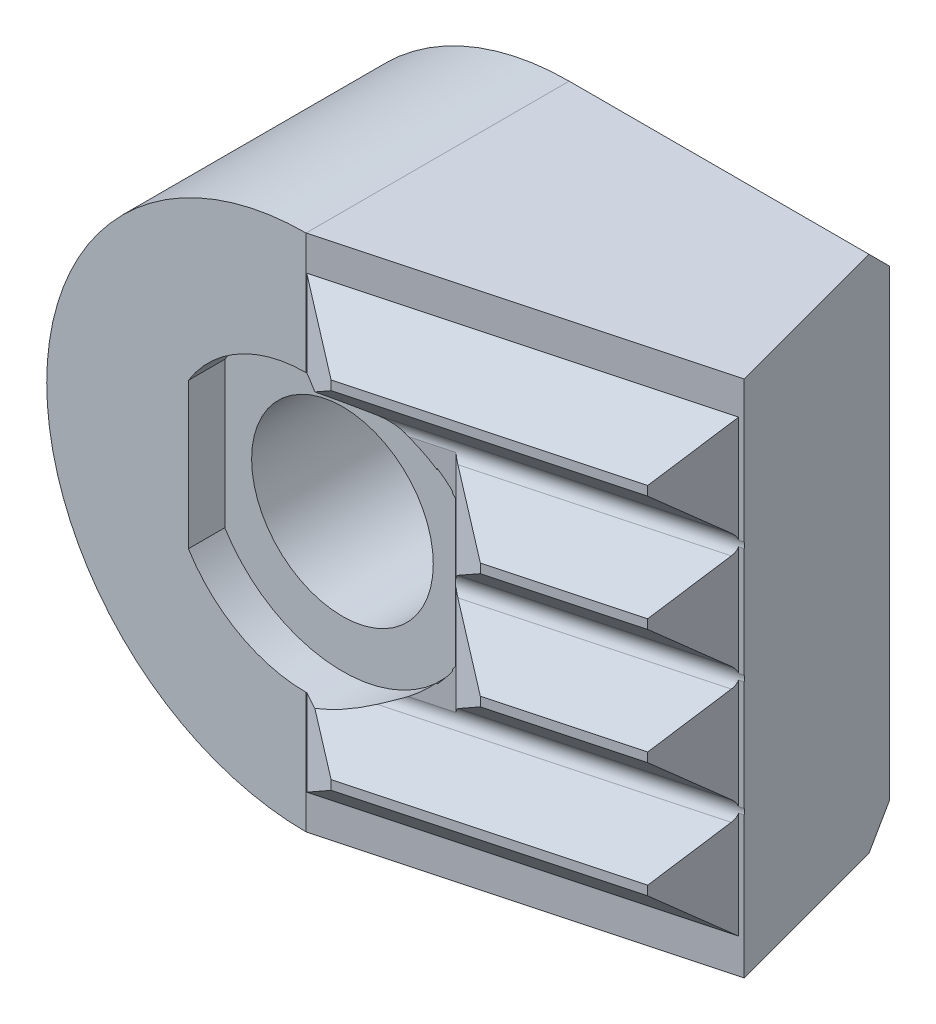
ISO-10303-21;
HEADER;
FILE_DESCRIPTION(('STEP AP214'),'2;1');
FILE_NAME('part.step','',(''),(''),'','','');
FILE_SCHEMA(('AUTOMOTIVE_DESIGN { 1 0 10303 214 1 1 1 1 }'));
ENDSEC;
DATA;
#1=APPLICATION_CONTEXT('core data for automotive mechanical design processes');
#2=APPLICATION_PROTOCOL_DEFINITION('international standard','automotive_design',2000,#1);
#3=PRODUCT_CONTEXT('',#1,'mechanical');
#4=PRODUCT('Part','Part','',(#3));
#5=PRODUCT_RELATED_PRODUCT_CATEGORY('part','',(#4));
#6=PRODUCT_DEFINITION_FORMATION('','',#4);
#7=PRODUCT_DEFINITION_CONTEXT('part definition',#1,'design');
#8=PRODUCT_DEFINITION('design','',#6,#7);
#9=PRODUCT_DEFINITION_SHAPE('','',#8);
#10=(LENGTH_UNIT() NAMED_UNIT(*) SI_UNIT(.MILLI.,.METRE.));
#11=(NAMED_UNIT(*) PLANE_ANGLE_UNIT() SI_UNIT($,.RADIAN.));
#12=(NAMED_UNIT(*) SI_UNIT($,.STERADIAN.) SOLID_ANGLE_UNIT());
#13=UNCERTAINTY_MEASURE_WITH_UNIT(LENGTH_MEASURE(1.E-05),#10,'distance_accuracy_value','');
#14=(GEOMETRIC_REPRESENTATION_CONTEXT(3) GLOBAL_UNCERTAINTY_ASSIGNED_CONTEXT((#13)) GLOBAL_UNIT_ASSIGNED_CONTEXT((#10,
#11,#12)) REPRESENTATION_CONTEXT('',''));
#15=CARTESIAN_POINT('',(0.,0.,0.));
#16=DIRECTION('',(0.,0.,1.));
#17=DIRECTION('',(1.,0.,0.));
#18=AXIS2_PLACEMENT_3D('',#15,#16,#17);
#19=CARTESIAN_POINT('',(0.,0.,0.762000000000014));
#20=DIRECTION('',(0.,0.,1.));
#21=DIRECTION('',(0.,-1.,0.));
#22=AXIS2_PLACEMENT_3D('',#19,#20,#21);
#23=CONICAL_SURFACE('',#22,7.1374,0.785398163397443);
#24=DIRECTION('',(0.,-0.707106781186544,0.707106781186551));
#25=VECTOR('',#24,1.);
#26=CARTESIAN_POINT('',(0.,-6.3754,0.));
#27=LINE('',#26,#25);
#28=CARTESIAN_POINT('',(0.,-6.3754,0.));
#29=VERTEX_POINT('',#28);
#30=CARTESIAN_POINT('',(0.,-7.1374,0.762000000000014));
#31=VERTEX_POINT('',#30);
#32=EDGE_CURVE('E475',#29,#31,#27,.T.);
#33=ORIENTED_EDGE('',*,*,#32,.T.);
#34=CARTESIAN_POINT('',(0.,0.,0.762000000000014));
#35=DIRECTION('',(0.,0.,1.));
#36=DIRECTION('',(0.,-1.,0.));
#37=AXIS2_PLACEMENT_3D('',#34,#35,#36);
#38=CIRCLE('',#37,7.1374);
#39=CARTESIAN_POINT('',(0.,7.1374,0.762000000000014));
#40=VERTEX_POINT('',#39);
#41=EDGE_CURVE('E540',#40,#31,#38,.T.);
#42=ORIENTED_EDGE('',*,*,#41,.F.);
#43=DIRECTION('',(0.,0.707106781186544,0.707106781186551));
#44=VECTOR('',#43,1.);
#45=CARTESIAN_POINT('',(0.,6.3754,0.));
#46=LINE('',#45,#44);
#47=CARTESIAN_POINT('',(0.,6.3754,0.));
#48=VERTEX_POINT('',#47);
#49=EDGE_CURVE('E472',#48,#40,#46,.T.);
#50=ORIENTED_EDGE('',*,*,#49,.F.);
#51=CARTESIAN_POINT('',(0.,0.,0.));
#52=DIRECTION('',(0.,0.,1.));
#53=DIRECTION('',(-1.,0.,0.));
#54=AXIS2_PLACEMENT_3D('',#51,#52,#53);
#55=CIRCLE('',#54,6.3754);
#56=EDGE_CURVE('E525',#29,#48,#55,.F.);
#57=ORIENTED_EDGE('',*,*,#56,.F.);
#58=EDGE_LOOP('',(#33,#42,#50,#57));
#59=FACE_BOUND('',#58,.T.);
#60=ADVANCED_FACE('F16',(#59),#23,.T.);
#61=CARTESIAN_POINT('',(-7.1374000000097,6.3754,0.));
#62=DIRECTION('',(0.,-0.707106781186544,0.707106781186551));
#63=DIRECTION('',(0.,-0.707106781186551,-0.707106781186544));
#64=AXIS2_PLACEMENT_3D('',#61,#62,#63);
#65=PLANE('',#64);
#66=ORIENTED_EDGE('',*,*,#49,.T.);
#67=DIRECTION('',(-1.,0.,0.));
#68=VECTOR('',#67,1.);
#69=CARTESIAN_POINT('',(-7.1374,7.1374,0.762));
#70=LINE('',#69,#68);
#71=CARTESIAN_POINT('',(8.25281865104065,7.1374,0.762));
#72=VERTEX_POINT('',#71);
#73=EDGE_CURVE('E536',#72,#40,#70,.T.);
#74=ORIENTED_EDGE('',*,*,#73,.F.);
#75=DIRECTION('',(-0.186156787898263,-0.694746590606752,-0.694746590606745));
#76=VECTOR('',#75,1.);
#77=CARTESIAN_POINT('',(7.52237897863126,4.4113620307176,-1.96403796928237));
#78=LINE('',#77,#76);
#79=CARTESIAN_POINT('',(8.0486413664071,6.3754,0.));
#80=VERTEX_POINT('',#79);
#81=EDGE_CURVE('E534',#80,#72,#78,.F.);
#82=ORIENTED_EDGE('',*,*,#81,.F.);
#83=DIRECTION('',(1.,0.,0.));
#84=VECTOR('',#83,1.);
#85=CARTESIAN_POINT('',(-7.1374000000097,6.3754,0.));
#86=LINE('',#85,#84);
#87=EDGE_CURVE('E529',#48,#80,#86,.T.);
#88=ORIENTED_EDGE('',*,*,#87,.F.);
#89=EDGE_LOOP('',(#66,#74,#82,#88));
#90=FACE_BOUND('',#89,.T.);
#91=ADVANCED_FACE('F635',(#90),#65,.F.);
#92=CARTESIAN_POINT('',(-7.1374,-7.1374,0.762000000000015));
#93=DIRECTION('',(0.,-0.707106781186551,-0.707106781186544));
#94=DIRECTION('',(0.,0.707106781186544,-0.707106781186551));
#95=AXIS2_PLACEMENT_3D('',#92,#93,#94);
#96=PLANE('',#95);
#97=DIRECTION('',(-0.186156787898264,0.694746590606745,-0.694746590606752));
#98=VECTOR('',#97,1.);
#99=CARTESIAN_POINT('',(7.7194806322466,-5.14695541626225,-1.22844458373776));
#100=LINE('',#99,#98);
#101=CARTESIAN_POINT('',(8.25281865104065,-7.1374,0.762000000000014));
#102=VERTEX_POINT('',#101);
#103=CARTESIAN_POINT('',(8.0486413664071,-6.3754,0.));
#104=VERTEX_POINT('',#103);
#105=EDGE_CURVE('E532',#102,#104,#100,.T.);
#106=ORIENTED_EDGE('',*,*,#105,.F.);
#107=DIRECTION('',(1.,0.,0.));
#108=VECTOR('',#107,1.);
#109=CARTESIAN_POINT('',(8.0486413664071,-7.1374,0.762000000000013));
#110=LINE('',#109,#108);
#111=EDGE_CURVE('E538',#31,#102,#110,.T.);
#112=ORIENTED_EDGE('',*,*,#111,.F.);
#113=ORIENTED_EDGE('',*,*,#32,.F.);
#114=DIRECTION('',(-1.,0.,0.));
#115=VECTOR('',#114,1.);
#116=CARTESIAN_POINT('',(0.,-6.3754,0.));
#117=LINE('',#116,#115);
#118=EDGE_CURVE('E527',#104,#29,#117,.T.);
#119=ORIENTED_EDGE('',*,*,#118,.F.);
#120=EDGE_LOOP('',(#106,#112,#113,#119));
#121=FACE_BOUND('',#120,.T.);
#122=ADVANCED_FACE('F630',(#121),#96,.T.);
#123=CARTESIAN_POINT('',(8.47158090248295,-7.1374,7.0714041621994));
#124=DIRECTION('',(-0.25881904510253,0.,-0.965925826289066));
#125=DIRECTION('',(0.965925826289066,0.,-0.25881904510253));
#126=AXIS2_PLACEMENT_3D('',#123,#124,#125);
#127=PLANE('',#126);
#128=DIRECTION('',(0.,-1.,0.));
#129=VECTOR('',#128,1.);
#130=CARTESIAN_POINT('',(4.8390929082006,3.175,8.04472638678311));
#131=LINE('',#130,#129);
#132=CARTESIAN_POINT('',(4.8390929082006,1.71449999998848,8.04472638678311));
#133=VERTEX_POINT('',#132);
#134=CARTESIAN_POINT('',(4.8390929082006,1.46050000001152,8.04472638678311));
#135=VERTEX_POINT('',#134);
#136=EDGE_CURVE('E785',#133,#135,#131,.T.);
#137=ORIENTED_EDGE('',*,*,#136,.T.);
#138=DIRECTION('',(0.965925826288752,0.,-0.258819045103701));
#139=VECTOR('',#138,1.);
#140=CARTESIAN_POINT('',(-6.55206922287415,1.4605,11.0969790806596));
#141=LINE('',#140,#139);
#142=CARTESIAN_POINT('',(8.4715809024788,1.4605,7.07140416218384));
#143=VERTEX_POINT('',#142);
#144=EDGE_CURVE('E385',#135,#143,#141,.T.);
#145=ORIENTED_EDGE('',*,*,#144,.T.);
#146=DIRECTION('',(0.,1.,0.));
#147=VECTOR('',#146,1.);
#148=CARTESIAN_POINT('',(8.47158090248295,-7.1374,7.0714041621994));
#149=LINE('',#148,#147);
#150=CARTESIAN_POINT('',(8.4715809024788,1.7145,7.07140416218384));
#151=VERTEX_POINT('',#150);
#152=EDGE_CURVE('E511',#143,#151,#149,.T.);
#153=ORIENTED_EDGE('',*,*,#152,.T.);
#154=DIRECTION('',(0.965925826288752,0.,-0.258819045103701));
#155=VECTOR('',#154,1.);
#156=CARTESIAN_POINT('',(-6.55206922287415,1.7145,11.0969790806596));
#157=LINE('',#156,#155);
#158=EDGE_CURVE('E387',#133,#151,#157,.T.);
#159=ORIENTED_EDGE('',*,*,#158,.F.);
#160=EDGE_LOOP('',(#137,#145,#153,#159));
#161=FACE_BOUND('',#160,.T.);
#162=ADVANCED_FACE('F623',(#161),#127,.F.);
#163=CARTESIAN_POINT('',(-6.55206922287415,1.4605,11.0969790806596));
#164=DIRECTION('',(0.183012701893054,-0.707106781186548,0.683012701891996));
#165=DIRECTION('',(0.,-0.694746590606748,-0.719254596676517));
#166=AXIS2_PLACEMENT_3D('',#163,#164,#165);
#167=PLANE('',#166);
#168=ORIENTED_EDGE('',*,*,#144,.F.);
#169=DIRECTION('',(-0.707106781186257,-0.577350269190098,-0.408248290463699));
#170=VECTOR('',#169,1.);
#171=CARTESIAN_POINT('',(0.0246212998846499,-2.47049960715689,5.26508990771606));
#172=LINE('',#171,#170);
#173=CARTESIAN_POINT('',(3.38030870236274,0.269407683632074,7.20249693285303));
#174=VERTEX_POINT('',#173);
#175=EDGE_CURVE('E1265',#135,#174,#172,.T.);
#176=ORIENTED_EDGE('',*,*,#175,.T.);
#177=DIRECTION('',(0.965925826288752,0.,-0.258819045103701));
#178=VECTOR('',#177,1.);
#179=CARTESIAN_POINT('',(-6.86034659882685,0.269407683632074,9.94647225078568));
#180=LINE('',#179,#178);
#181=CARTESIAN_POINT('',(9.3138103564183,0.269407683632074,5.61261995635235));
#182=VERTEX_POINT('',#181);
#183=EDGE_CURVE('E383',#174,#182,#180,.T.);
#184=ORIENTED_EDGE('',*,*,#183,.T.);
#185=DIRECTION('',(-0.408248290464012,0.577350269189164,0.707106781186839));
#186=VECTOR('',#185,1.);
#187=CARTESIAN_POINT('',(11.1084461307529,-2.26859056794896,2.5042196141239));
#188=LINE('',#187,#186);
#189=EDGE_CURVE('E445',#182,#143,#188,.T.);
#190=ORIENTED_EDGE('',*,*,#189,.T.);
#191=EDGE_LOOP('',(#168,#176,#184,#190));
#192=FACE_BOUND('',#191,.T.);
#193=ADVANCED_FACE('F616',(#192),#167,.T.);
#194=CARTESIAN_POINT('',(-6.55206922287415,-1.4605,11.0969790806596));
#195=DIRECTION('',(-0.183012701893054,-0.707106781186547,-0.683012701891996));
#196=DIRECTION('',(0.,0.694746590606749,-0.719254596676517));
#197=AXIS2_PLACEMENT_3D('',#194,#195,#196);
#198=PLANE('',#197);
#199=DIRECTION('',(-0.707106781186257,0.577350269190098,-0.408248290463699));
#200=VECTOR('',#199,1.);
#201=CARTESIAN_POINT('',(0.0246212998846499,2.47049960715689,5.26508990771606));
#202=LINE('',#201,#200);
#203=CARTESIAN_POINT('',(4.8390929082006,-1.46050000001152,8.04472638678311));
#204=VERTEX_POINT('',#203);
#205=CARTESIAN_POINT('',(3.38030870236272,-0.269407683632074,7.20249693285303));
#206=VERTEX_POINT('',#205);
#207=EDGE_CURVE('E743',#204,#206,#202,.T.);
#208=ORIENTED_EDGE('',*,*,#207,.F.);
#209=DIRECTION('',(0.965925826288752,0.,-0.258819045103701));
#210=VECTOR('',#209,1.);
#211=CARTESIAN_POINT('',(-6.55206922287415,-1.4605,11.0969790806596));
#212=LINE('',#211,#210);
#213=CARTESIAN_POINT('',(8.4715809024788,-1.4605,7.07140416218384));
#214=VERTEX_POINT('',#213);
#215=EDGE_CURVE('E379',#204,#214,#212,.T.);
#216=ORIENTED_EDGE('',*,*,#215,.T.);
#217=DIRECTION('',(-0.408248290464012,-0.577350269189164,0.707106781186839));
#218=VECTOR('',#217,1.);
#219=CARTESIAN_POINT('',(7.74384350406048,-2.4896760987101,8.33188231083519));
#220=LINE('',#219,#218);
#221=CARTESIAN_POINT('',(9.3138103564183,-0.269407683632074,5.61261995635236));
#222=VERTEX_POINT('',#221);
#223=EDGE_CURVE('E434',#222,#214,#220,.T.);
#224=ORIENTED_EDGE('',*,*,#223,.F.);
#225=DIRECTION('',(0.965925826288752,0.,-0.258819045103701));
#226=VECTOR('',#225,1.);
#227=CARTESIAN_POINT('',(-6.86034659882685,-0.269407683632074,9.94647225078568));
#228=LINE('',#227,#226);
#229=EDGE_CURVE('E381',#206,#222,#228,.T.);
#230=ORIENTED_EDGE('',*,*,#229,.F.);
#231=EDGE_LOOP('',(#208,#216,#224,#230));
#232=FACE_BOUND('',#231,.T.);
#233=ADVANCED_FACE('F612',(#232),#198,.F.);
#234=CARTESIAN_POINT('',(4.8390929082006,-1.71449999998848,8.04472638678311));
#235=VERTEX_POINT('',#234);
#236=EDGE_CURVE('E782',#204,#235,#131,.T.);
#237=ORIENTED_EDGE('',*,*,#236,.T.);
#238=DIRECTION('',(0.965925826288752,0.,-0.258819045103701));
#239=VECTOR('',#238,1.);
#240=CARTESIAN_POINT('',(-6.55206922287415,-1.7145,11.0969790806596));
#241=LINE('',#240,#239);
#242=CARTESIAN_POINT('',(8.4715809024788,-1.7145,7.07140416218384));
#243=VERTEX_POINT('',#242);
#244=EDGE_CURVE('E377',#235,#243,#241,.T.);
#245=ORIENTED_EDGE('',*,*,#244,.T.);
#246=EDGE_CURVE('E730',#243,#214,#149,.T.);
#247=ORIENTED_EDGE('',*,*,#246,.T.);
#248=ORIENTED_EDGE('',*,*,#215,.F.);
#249=EDGE_LOOP('',(#237,#245,#247,#248));
#250=FACE_BOUND('',#249,.T.);
#251=ADVANCED_FACE('F615',(#250),#127,.F.);
#252=CARTESIAN_POINT('',(9.3870620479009,-7.1374,5.48574430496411));
#253=DIRECTION('',(-0.866025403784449,0.,-0.499999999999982));
#254=DIRECTION('',(0.499999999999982,0.,-0.866025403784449));
#255=AXIS2_PLACEMENT_3D('',#252,#253,#254);
#256=PLANE('',#255);
#257=CARTESIAN_POINT('',(9.12331035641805,0.,5.94257563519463));
#258=DIRECTION('',(-0.866025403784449,0.,-0.499999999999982));
#259=DIRECTION('',(0.499999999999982,0.,-0.866025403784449));
#260=AXIS2_PLACEMENT_3D('',#257,#258,#259);
#261=ELLIPSE('',#260,0.538815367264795,0.381);
#262=CARTESIAN_POINT('',(9.3870620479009,-0.077660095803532,5.48574430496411));
#263=VERTEX_POINT('',#262);
#264=EDGE_CURVE('E441',#222,#263,#261,.F.);
#265=ORIENTED_EDGE('',*,*,#264,.F.);
#266=ORIENTED_EDGE('',*,*,#223,.T.);
#267=ORIENTED_EDGE('',*,*,#246,.F.);
#268=DIRECTION('',(-0.408248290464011,0.577350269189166,0.707106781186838));
#269=VECTOR('',#268,1.);
#270=CARTESIAN_POINT('',(10.3600914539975,-4.38525723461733,3.80040793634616));
#271=LINE('',#270,#269);
#272=CARTESIAN_POINT('',(9.3138103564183,-2.90559231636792,5.61261995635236));
#273=VERTEX_POINT('',#272);
#274=EDGE_CURVE('E431',#273,#243,#271,.T.);
#275=ORIENTED_EDGE('',*,*,#274,.F.);
#276=CARTESIAN_POINT('',(9.12331035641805,-3.175,5.94257563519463));
#277=DIRECTION('',(-0.866025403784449,0.,-0.499999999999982));
#278=DIRECTION('',(0.499999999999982,0.,-0.866025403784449));
#279=AXIS2_PLACEMENT_3D('',#276,#277,#278);
#280=ELLIPSE('',#279,0.538815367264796,0.381);
#281=CARTESIAN_POINT('',(9.3870620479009,-3.09733990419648,5.48574430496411));
#282=VERTEX_POINT('',#281);
#283=EDGE_CURVE('E422',#282,#273,#280,.F.);
#284=ORIENTED_EDGE('',*,*,#283,.F.);
#285=DIRECTION('',(0.,1.,0.));
#286=VECTOR('',#285,1.);
#287=CARTESIAN_POINT('',(9.3870620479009,-7.1374,5.48574430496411));
#288=LINE('',#287,#286);
#289=EDGE_CURVE('E703',#282,#263,#288,.T.);
#290=ORIENTED_EDGE('',*,*,#289,.T.);
#291=EDGE_LOOP('',(#265,#266,#267,#275,#284,#290));
#292=FACE_BOUND('',#291,.T.);
#293=ADVANCED_FACE('F727',(#292),#256,.F.);
#294=CARTESIAN_POINT('',(9.50973462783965,-7.1374,5.45287428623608));
#295=DIRECTION('',(-0.258819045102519,0.,-0.965925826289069));
#296=DIRECTION('',(0.965925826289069,0.,-0.258819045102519));
#297=AXIS2_PLACEMENT_3D('',#294,#295,#296);
#298=PLANE('',#297);
#299=DIRECTION('',(0.965925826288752,0.,-0.258819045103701));
#300=VECTOR('',#299,1.);
#301=CARTESIAN_POINT('',(-6.88715857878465,-0.0776600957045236,9.84640857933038));
#302=LINE('',#301,#300);
#303=CARTESIAN_POINT('',(9.50973462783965,-0.077660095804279,5.45287428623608));
#304=VERTEX_POINT('',#303);
#305=EDGE_CURVE('E443',#263,#304,#302,.T.);
#306=ORIENTED_EDGE('',*,*,#305,.F.);
#307=ORIENTED_EDGE('',*,*,#289,.F.);
#308=DIRECTION('',(0.965925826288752,0.,-0.258819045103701));
#309=VECTOR('',#308,1.);
#310=CARTESIAN_POINT('',(-6.88715857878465,-3.09733990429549,9.84640857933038));
#311=LINE('',#310,#309);
#312=CARTESIAN_POINT('',(9.50973462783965,-3.09733990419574,5.45287428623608));
#313=VERTEX_POINT('',#312);
#314=EDGE_CURVE('E425',#313,#282,#311,.F.);
#315=ORIENTED_EDGE('',*,*,#314,.F.);
#316=DIRECTION('',(0.,1.,0.));
#317=VECTOR('',#316,1.);
#318=CARTESIAN_POINT('',(9.50973462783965,-7.1374,5.45287428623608));
#319=LINE('',#318,#317);
#320=EDGE_CURVE('E521',#313,#304,#319,.T.);
#321=ORIENTED_EDGE('',*,*,#320,.T.);
#322=EDGE_LOOP('',(#306,#307,#315,#321));
#323=FACE_BOUND('',#322,.T.);
#324=ADVANCED_FACE('F610',(#323),#298,.F.);
#325=CARTESIAN_POINT('',(-6.55206922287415,-1.7145,11.0969790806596));
#326=DIRECTION('',(0.183012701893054,-0.707106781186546,0.683012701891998));
#327=DIRECTION('',(0.,-0.69474659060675,-0.719254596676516));
#328=AXIS2_PLACEMENT_3D('',#325,#326,#327);
#329=PLANE('',#328);
#330=ORIENTED_EDGE('',*,*,#244,.F.);
#331=DIRECTION('',(-0.707106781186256,-0.577350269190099,-0.408248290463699));
#332=VECTOR('',#331,1.);
#333=CARTESIAN_POINT('',(0.0246212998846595,-5.6454996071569,5.26508990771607));
#334=LINE('',#333,#332);
#335=CARTESIAN_POINT('',(3.38030870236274,-2.90559231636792,7.20249693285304));
#336=VERTEX_POINT('',#335);
#337=EDGE_CURVE('E733',#235,#336,#334,.T.);
#338=ORIENTED_EDGE('',*,*,#337,.T.);
#339=DIRECTION('',(0.965925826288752,0.,-0.258819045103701));
#340=VECTOR('',#339,1.);
#341=CARTESIAN_POINT('',(-6.86034659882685,-2.90559231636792,9.9464722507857));
#342=LINE('',#341,#340);
#343=EDGE_CURVE('E375',#336,#273,#342,.T.);
#344=ORIENTED_EDGE('',*,*,#343,.T.);
#345=ORIENTED_EDGE('',*,*,#274,.T.);
#346=EDGE_LOOP('',(#330,#338,#344,#345));
#347=FACE_BOUND('',#346,.T.);
#348=ADVANCED_FACE('F606',(#347),#329,.T.);
#349=CARTESIAN_POINT('',(8.4715809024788,-4.8895,7.07140416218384));
#350=VERTEX_POINT('',#349);
#351=CARTESIAN_POINT('',(8.4715809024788,-4.6355,7.07140416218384));
#352=VERTEX_POINT('',#351);
#353=EDGE_CURVE('E512',#350,#352,#149,.T.);
#354=ORIENTED_EDGE('',*,*,#353,.T.);
#355=DIRECTION('',(0.965925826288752,0.,-0.258819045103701));
#356=VECTOR('',#355,1.);
#357=CARTESIAN_POINT('',(-6.55206922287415,-4.6355,11.0969790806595));
#358=LINE('',#357,#356);
#359=CARTESIAN_POINT('',(1.60053679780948,-4.6355,8.9124948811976));
#360=VERTEX_POINT('',#359);
#361=EDGE_CURVE('E370',#360,#352,#358,.T.);
#362=ORIENTED_EDGE('',*,*,#361,.F.);
#363=DIRECTION('',(0.,1.,0.));
#364=VECTOR('',#363,1.);
#365=CARTESIAN_POINT('',(1.60053679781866,-7.1374,8.9124948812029));
#366=LINE('',#365,#364);
#367=CARTESIAN_POINT('',(1.60053679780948,-4.8895,8.9124948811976));
#368=VERTEX_POINT('',#367);
#369=EDGE_CURVE('E507',#368,#360,#366,.T.);
#370=ORIENTED_EDGE('',*,*,#369,.F.);
#371=DIRECTION('',(0.965925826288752,0.,-0.258819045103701));
#372=VECTOR('',#371,1.);
#373=CARTESIAN_POINT('',(-6.55206922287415,-4.8895,11.0969790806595));
#374=LINE('',#373,#372);
#375=EDGE_CURVE('E367',#368,#350,#374,.T.);
#376=ORIENTED_EDGE('',*,*,#375,.T.);
#377=EDGE_LOOP('',(#354,#362,#370,#376));
#378=FACE_BOUND('',#377,.T.);
#379=ADVANCED_FACE('F609',(#378),#127,.F.);
#380=CARTESIAN_POINT('',(-7.1374,-7.1374,8.001));
#381=DIRECTION('',(0.,-1.,0.));
#382=DIRECTION('',(0.,0.,-1.));
#383=AXIS2_PLACEMENT_3D('',#380,#381,#382);
#384=PLANE('',#383);
#385=DIRECTION('',(0.258819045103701,0.,0.965925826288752));
#386=VECTOR('',#385,1.);
#387=CARTESIAN_POINT('',(8.0486413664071,-7.1374,0.));
#388=LINE('',#387,#386);
#389=CARTESIAN_POINT('',(9.50973462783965,-7.1374,5.45287428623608));
#390=VERTEX_POINT('',#389);
#391=EDGE_CURVE('E495',#102,#390,#388,.T.);
#392=ORIENTED_EDGE('',*,*,#391,.T.);
#393=DIRECTION('',(-0.965925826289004,0.,0.258819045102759));
#394=VECTOR('',#393,1.);
#395=CARTESIAN_POINT('',(0.0148769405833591,-7.1374,7.99701373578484));
#396=LINE('',#395,#394);
#397=CARTESIAN_POINT('',(0.,-7.1374,8.001));
#398=VERTEX_POINT('',#397);
#399=EDGE_CURVE('E492',#390,#398,#396,.T.);
#400=ORIENTED_EDGE('',*,*,#399,.T.);
#401=DIRECTION('',(0.,0.,-1.));
#402=VECTOR('',#401,1.);
#403=CARTESIAN_POINT('',(0.,-7.1374,8.001));
#404=LINE('',#403,#402);
#405=EDGE_CURVE('E478',#398,#31,#404,.T.);
#406=ORIENTED_EDGE('',*,*,#405,.T.);
#407=ORIENTED_EDGE('',*,*,#111,.T.);
#408=EDGE_LOOP('',(#392,#400,#406,#407));
#409=FACE_BOUND('',#408,.T.);
#410=ADVANCED_FACE('F656',(#409),#384,.T.);
#411=CARTESIAN_POINT('',(-6.55206922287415,-4.8895,11.0969790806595));
#412=DIRECTION('',(0.183012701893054,-0.707106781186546,0.683012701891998));
#413=DIRECTION('',(0.,-0.69474659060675,-0.719254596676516));
#414=AXIS2_PLACEMENT_3D('',#411,#412,#413);
#415=PLANE('',#414);
#416=DIRECTION('',(-0.408248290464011,0.577350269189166,0.707106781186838));
#417=VECTOR('',#416,1.);
#418=CARTESIAN_POINT('',(9.61173677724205,-6.50192390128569,5.09659625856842));
#419=LINE('',#418,#417);
#420=CARTESIAN_POINT('',(9.3870620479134,-6.18418585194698,5.48574430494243));
#421=VERTEX_POINT('',#420);
#422=EDGE_CURVE('E454',#421,#350,#419,.T.);
#423=ORIENTED_EDGE('',*,*,#422,.T.);
#424=ORIENTED_EDGE('',*,*,#375,.F.);
#425=DIRECTION('',(-0.707106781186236,-0.577350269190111,-0.408248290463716));
#426=VECTOR('',#425,1.);
#427=CARTESIAN_POINT('',(0.68283546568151,-5.63879999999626,8.3826597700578));
#428=LINE('',#427,#426);
#429=CARTESIAN_POINT('',(0.0148769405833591,-6.18418585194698,7.99701373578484));
#430=VERTEX_POINT('',#429);
#431=EDGE_CURVE('E1264',#368,#430,#428,.T.);
#432=ORIENTED_EDGE('',*,*,#431,.T.);
#433=DIRECTION('',(0.965925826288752,0.,-0.258819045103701));
#434=VECTOR('',#433,1.);
#435=CARTESIAN_POINT('',(-6.88715857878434,-6.18418585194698,9.8464085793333));
#436=LINE('',#435,#434);
#437=EDGE_CURVE('E365',#430,#421,#436,.T.);
#438=ORIENTED_EDGE('',*,*,#437,.T.);
#439=EDGE_LOOP('',(#423,#424,#432,#438));
#440=FACE_BOUND('',#439,.T.);
#441=ADVANCED_FACE('F659',(#440),#415,.T.);
#442=CARTESIAN_POINT('',(9.31381035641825,-3.44440768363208,5.61261995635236));
#443=VERTEX_POINT('',#442);
#444=CARTESIAN_POINT('',(9.3870620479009,-3.25266009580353,5.48574430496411));
#445=VERTEX_POINT('',#444);
#446=EDGE_CURVE('E426',#443,#445,#280,.F.);
#447=ORIENTED_EDGE('',*,*,#446,.F.);
#448=DIRECTION('',(-0.408248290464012,-0.577350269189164,0.707106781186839));
#449=VECTOR('',#448,1.);
#450=CARTESIAN_POINT('',(8.4921981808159,-4.60634276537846,7.03569398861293));
#451=LINE('',#450,#449);
#452=EDGE_CURVE('E419',#443,#352,#451,.T.);
#453=ORIENTED_EDGE('',*,*,#452,.T.);
#454=ORIENTED_EDGE('',*,*,#353,.F.);
#455=ORIENTED_EDGE('',*,*,#422,.F.);
#456=EDGE_CURVE('E517',#421,#445,#288,.T.);
#457=ORIENTED_EDGE('',*,*,#456,.T.);
#458=EDGE_LOOP('',(#447,#453,#454,#455,#457));
#459=FACE_BOUND('',#458,.T.);
#460=ADVANCED_FACE('F651',(#459),#256,.F.);
#461=CARTESIAN_POINT('',(0.,0.,8.001));
#462=DIRECTION('',(0.,0.,-1.));
#463=DIRECTION('',(0.,1.,0.));
#464=AXIS2_PLACEMENT_3D('',#461,#462,#463);
#465=CYLINDRICAL_SURFACE('',#464,7.1374);
#466=DIRECTION('',(0.,0.,-1.));
#467=VECTOR('',#466,1.);
#468=CARTESIAN_POINT('',(0.,7.1374,8.001));
#469=LINE('',#468,#467);
#470=CARTESIAN_POINT('',(0.,7.1374,8.001));
#471=VERTEX_POINT('',#470);
#472=EDGE_CURVE('E482',#471,#40,#469,.T.);
#473=ORIENTED_EDGE('',*,*,#472,.T.);
#474=ORIENTED_EDGE('',*,*,#41,.T.);
#475=ORIENTED_EDGE('',*,*,#405,.F.);
#476=CARTESIAN_POINT('',(0.,0.,8.001));
#477=DIRECTION('',(0.,0.,-1.));
#478=DIRECTION('',(0.,1.,0.));
#479=AXIS2_PLACEMENT_3D('',#476,#477,#478);
#480=CIRCLE('',#479,7.1374);
#481=EDGE_CURVE('E479',#398,#471,#480,.T.);
#482=ORIENTED_EDGE('',*,*,#481,.T.);
#483=EDGE_LOOP('',(#473,#474,#475,#482));
#484=FACE_BOUND('',#483,.T.);
#485=ADVANCED_FACE('F648',(#484),#465,.T.);
#486=CARTESIAN_POINT('',(-7.1374,7.1374,8.001));
#487=DIRECTION('',(0.,-1.,0.));
#488=DIRECTION('',(0.,0.,-1.));
#489=AXIS2_PLACEMENT_3D('',#486,#487,#488);
#490=PLANE('',#489);
#491=ORIENTED_EDGE('',*,*,#472,.F.);
#492=DIRECTION('',(-0.965925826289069,0.,0.258819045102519));
#493=VECTOR('',#492,1.);
#494=CARTESIAN_POINT('',(9.50973462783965,7.1374,5.45287428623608));
#495=LINE('',#494,#493);
#496=CARTESIAN_POINT('',(9.50973462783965,7.1374,5.45287428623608));
#497=VERTEX_POINT('',#496);
#498=EDGE_CURVE('E485',#497,#471,#495,.T.);
#499=ORIENTED_EDGE('',*,*,#498,.F.);
#500=DIRECTION('',(0.258819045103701,0.,0.965925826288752));
#501=VECTOR('',#500,1.);
#502=CARTESIAN_POINT('',(8.0486413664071,7.1374,0.));
#503=LINE('',#502,#501);
#504=EDGE_CURVE('E489',#72,#497,#503,.T.);
#505=ORIENTED_EDGE('',*,*,#504,.F.);
#506=ORIENTED_EDGE('',*,*,#73,.T.);
#507=EDGE_LOOP('',(#491,#499,#505,#506));
#508=FACE_BOUND('',#507,.T.);
#509=ADVANCED_FACE('F579',(#508),#490,.F.);
#510=CARTESIAN_POINT('',(-6.55206922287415,4.8895,11.0969790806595));
#511=DIRECTION('',(-0.183012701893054,-0.707106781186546,-0.683012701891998));
#512=DIRECTION('',(0.,0.69474659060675,-0.719254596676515));
#513=AXIS2_PLACEMENT_3D('',#510,#511,#512);
#514=PLANE('',#513);
#515=DIRECTION('',(0.965925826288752,0.,-0.258819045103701));
#516=VECTOR('',#515,1.);
#517=CARTESIAN_POINT('',(-6.55206922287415,4.8895,11.0969790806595));
#518=LINE('',#517,#516);
#519=CARTESIAN_POINT('',(1.60053679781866,4.8894999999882,8.9124948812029));
#520=VERTEX_POINT('',#519);
#521=CARTESIAN_POINT('',(8.4715809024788,4.8895,7.07140416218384));
#522=VERTEX_POINT('',#521);
#523=EDGE_CURVE('E397',#520,#522,#518,.T.);
#524=ORIENTED_EDGE('',*,*,#523,.T.);
#525=DIRECTION('',(-0.408248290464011,-0.577350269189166,0.707106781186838));
#526=VECTOR('',#525,1.);
#527=CARTESIAN_POINT('',(6.2471341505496,1.7436572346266,10.9242589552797));
#528=LINE('',#527,#526);
#529=CARTESIAN_POINT('',(9.3870620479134,6.18418585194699,5.48574430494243));
#530=VERTEX_POINT('',#529);
#531=EDGE_CURVE('E448',#530,#522,#528,.T.);
#532=ORIENTED_EDGE('',*,*,#531,.F.);
#533=DIRECTION('',(0.965925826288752,0.,-0.258819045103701));
#534=VECTOR('',#533,1.);
#535=CARTESIAN_POINT('',(-6.88715857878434,6.18418585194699,9.8464085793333));
#536=LINE('',#535,#534);
#537=CARTESIAN_POINT('',(0.0148769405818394,6.18418585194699,7.99701373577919));
#538=VERTEX_POINT('',#537);
#539=EDGE_CURVE('E399',#538,#530,#536,.T.);
#540=ORIENTED_EDGE('',*,*,#539,.F.);
#541=DIRECTION('',(-0.707106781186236,0.577350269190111,-0.408248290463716));
#542=VECTOR('',#541,1.);
#543=CARTESIAN_POINT('',(6.5104981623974,0.880533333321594,11.7472623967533));
#544=LINE('',#543,#542);
#545=EDGE_CURVE('E451',#520,#538,#544,.T.);
#546=ORIENTED_EDGE('',*,*,#545,.F.);
#547=EDGE_LOOP('',(#524,#532,#540,#546));
#548=FACE_BOUND('',#547,.T.);
#549=ADVANCED_FACE('F576',(#548),#514,.F.);
#550=CARTESIAN_POINT('',(8.4715809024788,4.6355,7.07140416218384));
#551=VERTEX_POINT('',#550);
#552=EDGE_CURVE('E508',#551,#522,#149,.T.);
#553=ORIENTED_EDGE('',*,*,#552,.T.);
#554=ORIENTED_EDGE('',*,*,#523,.F.);
#555=CARTESIAN_POINT('',(1.60053679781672,4.6355,8.91249488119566));
#556=VERTEX_POINT('',#555);
#557=EDGE_CURVE('E504',#556,#520,#366,.T.);
#558=ORIENTED_EDGE('',*,*,#557,.F.);
#559=DIRECTION('',(0.965925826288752,0.,-0.258819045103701));
#560=VECTOR('',#559,1.);
#561=CARTESIAN_POINT('',(-6.55206922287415,4.6355,11.0969790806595));
#562=LINE('',#561,#560);
#563=EDGE_CURVE('E394',#556,#551,#562,.T.);
#564=ORIENTED_EDGE('',*,*,#563,.T.);
#565=EDGE_LOOP('',(#553,#554,#558,#564));
#566=FACE_BOUND('',#565,.T.);
#567=ADVANCED_FACE('F578',(#566),#127,.F.);
#568=CARTESIAN_POINT('',(9.3870620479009,3.25266009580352,5.48574430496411));
#569=VERTEX_POINT('',#568);
#570=EDGE_CURVE('E513',#569,#530,#288,.T.);
#571=ORIENTED_EDGE('',*,*,#570,.T.);
#572=ORIENTED_EDGE('',*,*,#531,.T.);
#573=ORIENTED_EDGE('',*,*,#552,.F.);
#574=DIRECTION('',(-0.408248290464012,0.577350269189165,0.707106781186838));
#575=VECTOR('',#574,1.);
#576=CARTESIAN_POINT('',(11.8568008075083,-0.151923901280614,1.20803129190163));
#577=LINE('',#576,#575);
#578=CARTESIAN_POINT('',(9.3138103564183,3.44440768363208,5.61261995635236));
#579=VERTEX_POINT('',#578);
#580=EDGE_CURVE('E414',#579,#551,#577,.T.);
#581=ORIENTED_EDGE('',*,*,#580,.F.);
#582=CARTESIAN_POINT('',(9.12331035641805,3.175,5.94257563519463));
#583=DIRECTION('',(-0.866025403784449,0.,-0.499999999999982));
#584=DIRECTION('',(0.499999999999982,0.,-0.866025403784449));
#585=AXIS2_PLACEMENT_3D('',#582,#583,#584);
#586=ELLIPSE('',#585,0.538815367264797,0.381);
#587=EDGE_CURVE('E405',#569,#579,#586,.F.);
#588=ORIENTED_EDGE('',*,*,#587,.F.);
#589=EDGE_LOOP('',(#571,#572,#573,#581,#588));
#590=FACE_BOUND('',#589,.T.);
#591=ADVANCED_FACE('F674',(#590),#256,.F.);
#592=CARTESIAN_POINT('',(8.0486413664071,-7.1374,0.));
#593=DIRECTION('',(-0.965925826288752,0.,0.258819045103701));
#594=DIRECTION('',(-0.258819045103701,0.,-0.965925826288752));
#595=AXIS2_PLACEMENT_3D('',#592,#593,#594);
#596=PLANE('',#595);
#597=CARTESIAN_POINT('',(9.60627444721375,3.175,5.81316579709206));
#598=DIRECTION('',(-0.965925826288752,0.,0.258819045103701));
#599=DIRECTION('',(-0.258819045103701,0.,-0.965925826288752));
#600=AXIS2_PLACEMENT_3D('',#597,#598,#599);
#601=CIRCLE('',#600,0.381);
#602=CARTESIAN_POINT('',(9.50973462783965,3.25266009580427,5.45287428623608));
#603=VERTEX_POINT('',#602);
#604=CARTESIAN_POINT('',(9.50973462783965,3.09733990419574,5.45287428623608));
#605=VERTEX_POINT('',#604);
#606=EDGE_CURVE('E362',#603,#605,#601,.T.);
#607=ORIENTED_EDGE('',*,*,#606,.T.);
#608=CARTESIAN_POINT('',(9.50973462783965,0.077660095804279,5.45287428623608));
#609=VERTEX_POINT('',#608);
#610=EDGE_CURVE('E695',#609,#605,#319,.T.);
#611=ORIENTED_EDGE('',*,*,#610,.F.);
#612=CARTESIAN_POINT('',(9.60627444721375,0.,5.81316579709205));
#613=DIRECTION('',(-0.965925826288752,0.,0.258819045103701));
#614=DIRECTION('',(-0.258819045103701,0.,-0.965925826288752));
#615=AXIS2_PLACEMENT_3D('',#612,#613,#614);
#616=CIRCLE('',#615,0.381);
#617=EDGE_CURVE('E359',#609,#304,#616,.T.);
#618=ORIENTED_EDGE('',*,*,#617,.T.);
#619=ORIENTED_EDGE('',*,*,#320,.F.);
#620=CARTESIAN_POINT('',(9.60627444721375,-3.175,5.81316579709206));
#621=DIRECTION('',(-0.965925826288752,0.,0.258819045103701));
#622=DIRECTION('',(-0.258819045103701,0.,-0.965925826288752));
#623=AXIS2_PLACEMENT_3D('',#620,#621,#622);
#624=CIRCLE('',#623,0.381);
#625=CARTESIAN_POINT('',(9.50973462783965,-3.25266009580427,5.45287428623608));
#626=VERTEX_POINT('',#625);
#627=EDGE_CURVE('E356',#313,#626,#624,.T.);
#628=ORIENTED_EDGE('',*,*,#627,.T.);
#629=EDGE_CURVE('E518',#390,#626,#319,.T.);
#630=ORIENTED_EDGE('',*,*,#629,.F.);
#631=ORIENTED_EDGE('',*,*,#391,.F.);
#632=ORIENTED_EDGE('',*,*,#105,.T.);
#633=DIRECTION('',(0.,1.,0.));
#634=VECTOR('',#633,1.);
#635=CARTESIAN_POINT('',(8.0486413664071,-7.1374,0.));
#636=LINE('',#635,#634);
#637=EDGE_CURVE('E520',#104,#80,#636,.T.);
#638=ORIENTED_EDGE('',*,*,#637,.T.);
#639=ORIENTED_EDGE('',*,*,#81,.T.);
#640=ORIENTED_EDGE('',*,*,#504,.T.);
#641=EDGE_CURVE('E522',#603,#497,#319,.T.);
#642=ORIENTED_EDGE('',*,*,#641,.F.);
#643=EDGE_LOOP('',(#607,#611,#618,#619,#628,#630,#631,#632,#638,#639,#640,#642));
#644=FACE_BOUND('',#643,.T.);
#645=ADVANCED_FACE('F678',(#644),#596,.F.);
#646=DIRECTION('',(0.965925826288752,0.,-0.258819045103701));
#647=VECTOR('',#646,1.);
#648=CARTESIAN_POINT('',(-6.88715857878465,3.0973399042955,9.84640857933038));
#649=LINE('',#648,#647);
#650=CARTESIAN_POINT('',(9.3870620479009,3.09733990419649,5.48574430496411));
#651=VERTEX_POINT('',#650);
#652=EDGE_CURVE('E410',#651,#605,#649,.T.);
#653=ORIENTED_EDGE('',*,*,#652,.F.);
#654=CARTESIAN_POINT('',(9.3870620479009,0.077660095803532,5.48574430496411));
#655=VERTEX_POINT('',#654);
#656=EDGE_CURVE('E516',#655,#651,#288,.T.);
#657=ORIENTED_EDGE('',*,*,#656,.F.);
#658=DIRECTION('',(0.965925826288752,0.,-0.258819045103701));
#659=VECTOR('',#658,1.);
#660=CARTESIAN_POINT('',(-6.88715857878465,0.0776600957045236,9.84640857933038));
#661=LINE('',#660,#659);
#662=EDGE_CURVE('E440',#609,#655,#661,.F.);
#663=ORIENTED_EDGE('',*,*,#662,.F.);
#664=ORIENTED_EDGE('',*,*,#610,.T.);
#665=EDGE_LOOP('',(#653,#657,#663,#664));
#666=FACE_BOUND('',#665,.T.);
#667=ADVANCED_FACE('F684',(#666),#298,.F.);
#668=CARTESIAN_POINT('',(9.3138103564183,2.90559231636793,5.61261995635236));
#669=VERTEX_POINT('',#668);
#670=EDGE_CURVE('E408',#669,#651,#586,.F.);
#671=ORIENTED_EDGE('',*,*,#670,.F.);
#672=DIRECTION('',(-0.408248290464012,-0.577350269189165,0.707106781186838));
#673=VECTOR('',#672,1.);
#674=CARTESIAN_POINT('',(6.99548882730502,-0.373009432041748,9.62807063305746));
#675=LINE('',#674,#673);
#676=EDGE_CURVE('E402',#669,#151,#675,.T.);
#677=ORIENTED_EDGE('',*,*,#676,.T.);
#678=ORIENTED_EDGE('',*,*,#152,.F.);
#679=ORIENTED_EDGE('',*,*,#189,.F.);
#680=EDGE_CURVE('E437',#655,#182,#261,.F.);
#681=ORIENTED_EDGE('',*,*,#680,.F.);
#682=ORIENTED_EDGE('',*,*,#656,.T.);
#683=EDGE_LOOP('',(#671,#677,#678,#679,#681,#682));
#684=FACE_BOUND('',#683,.T.);
#685=ADVANCED_FACE('F680',(#684),#256,.F.);
#686=CARTESIAN_POINT('',(-6.55206922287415,1.7145,11.0969790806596));
#687=DIRECTION('',(-0.183012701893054,-0.707106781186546,-0.683012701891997));
#688=DIRECTION('',(0.,0.69474659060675,-0.719254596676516));
#689=AXIS2_PLACEMENT_3D('',#686,#687,#688);
#690=PLANE('',#689);
#691=DIRECTION('',(-0.707106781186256,0.577350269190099,-0.408248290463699));
#692=VECTOR('',#691,1.);
#693=CARTESIAN_POINT('',(0.0246212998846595,5.64549960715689,5.26508990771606));
#694=LINE('',#693,#692);
#695=CARTESIAN_POINT('',(3.38030870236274,2.90559231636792,7.20249693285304));
#696=VERTEX_POINT('',#695);
#697=EDGE_CURVE('E741',#133,#696,#694,.T.);
#698=ORIENTED_EDGE('',*,*,#697,.F.);
#699=ORIENTED_EDGE('',*,*,#158,.T.);
#700=ORIENTED_EDGE('',*,*,#676,.F.);
#701=DIRECTION('',(0.965925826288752,0.,-0.258819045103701));
#702=VECTOR('',#701,1.);
#703=CARTESIAN_POINT('',(-6.86034659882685,2.90559231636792,9.9464722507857));
#704=LINE('',#703,#702);
#705=EDGE_CURVE('E389',#696,#669,#704,.T.);
#706=ORIENTED_EDGE('',*,*,#705,.F.);
#707=EDGE_LOOP('',(#698,#699,#700,#706));
#708=FACE_BOUND('',#707,.T.);
#709=ADVANCED_FACE('F570',(#708),#690,.F.);
#710=CARTESIAN_POINT('',(4.8390929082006,3.175,8.04472638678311));
#711=DIRECTION('',(-0.5,0.,0.866025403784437));
#712=DIRECTION('',(-0.866025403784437,0.,-0.5));
#713=AXIS2_PLACEMENT_3D('',#710,#711,#712);
#714=PLANE('',#713);
#715=ORIENTED_EDGE('',*,*,#697,.T.);
#716=CARTESIAN_POINT('',(3.7102643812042,3.175,7.39299693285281));
#717=DIRECTION('',(-0.5,0.,0.866025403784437));
#718=DIRECTION('',(0.866025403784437,0.,0.5));
#719=AXIS2_PLACEMENT_3D('',#716,#717,#718);
#720=ELLIPSE('',#719,0.53881536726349,0.381);
#721=CARTESIAN_POINT('',(3.2534330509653,3.09733990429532,7.12924524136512));
#722=VERTEX_POINT('',#721);
#723=EDGE_CURVE('E738',#722,#696,#720,.T.);
#724=ORIENTED_EDGE('',*,*,#723,.F.);
#725=DIRECTION('',(0.,-1.,0.));
#726=VECTOR('',#725,1.);
#727=CARTESIAN_POINT('',(3.2534330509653,3.175,7.12924524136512));
#728=LINE('',#727,#726);
#729=CARTESIAN_POINT('',(3.2534330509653,0.0776600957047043,7.12924524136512));
#730=VERTEX_POINT('',#729);
#731=EDGE_CURVE('E779',#722,#730,#728,.T.);
#732=ORIENTED_EDGE('',*,*,#731,.T.);
#733=CARTESIAN_POINT('',(3.7102643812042,0.,7.3929969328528));
#734=DIRECTION('',(-0.5,0.,0.866025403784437));
#735=DIRECTION('',(0.866025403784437,0.,0.5));
#736=AXIS2_PLACEMENT_3D('',#733,#734,#735);
#737=ELLIPSE('',#736,0.538815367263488,0.381);
#738=EDGE_CURVE('E791',#174,#730,#737,.T.);
#739=ORIENTED_EDGE('',*,*,#738,.F.);
#740=ORIENTED_EDGE('',*,*,#175,.F.);
#741=ORIENTED_EDGE('',*,*,#136,.F.);
#742=EDGE_LOOP('',(#715,#724,#732,#739,#740,#741));
#743=FACE_BOUND('',#742,.T.);
#744=ADVANCED_FACE('F620',(#743),#714,.T.);
#745=CARTESIAN_POINT('',(-6.7906187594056,0.,10.2067000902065));
#746=DIRECTION('',(0.965925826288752,0.,-0.258819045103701));
#747=DIRECTION('',(0.258819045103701,0.,0.965925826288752));
#748=AXIS2_PLACEMENT_3D('',#745,#746,#747);
#749=CYLINDRICAL_SURFACE('',#748,0.381);
#750=DIRECTION('',(0.965925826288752,0.,-0.258819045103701));
#751=VECTOR('',#750,1.);
#752=CARTESIAN_POINT('',(-6.88715857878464,-0.0776600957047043,9.8464085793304));
#753=LINE('',#752,#751);
#754=CARTESIAN_POINT('',(3.2385,-0.0776600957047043,7.13324654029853));
#755=VERTEX_POINT('',#754);
#756=CARTESIAN_POINT('',(3.2534330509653,-0.0776600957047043,7.12924524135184));
#757=VERTEX_POINT('',#756);
#758=EDGE_CURVE('E798',#755,#757,#753,.T.);
#759=ORIENTED_EDGE('',*,*,#758,.T.);
#760=EDGE_CURVE('E792',#757,#206,#737,.T.);
#761=ORIENTED_EDGE('',*,*,#760,.T.);
#762=ORIENTED_EDGE('',*,*,#229,.T.);
#763=ORIENTED_EDGE('',*,*,#264,.T.);
#764=ORIENTED_EDGE('',*,*,#305,.T.);
#765=ORIENTED_EDGE('',*,*,#617,.F.);
#766=ORIENTED_EDGE('',*,*,#662,.T.);
#767=ORIENTED_EDGE('',*,*,#680,.T.);
#768=ORIENTED_EDGE('',*,*,#183,.F.);
#769=ORIENTED_EDGE('',*,*,#738,.T.);
#770=DIRECTION('',(0.965925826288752,0.,-0.258819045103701));
#771=VECTOR('',#770,1.);
#772=CARTESIAN_POINT('',(-6.88715857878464,0.0776600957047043,9.8464085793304));
#773=LINE('',#772,#771);
#774=CARTESIAN_POINT('',(3.2385,0.0776600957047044,7.1332465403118));
#775=VERTEX_POINT('',#774);
#776=EDGE_CURVE('E781',#730,#775,#773,.F.);
#777=ORIENTED_EDGE('',*,*,#776,.T.);
#778=CARTESIAN_POINT('',(3.2385,0.,7.51940581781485));
#779=DIRECTION('',(-1.,0.,0.));
#780=DIRECTION('',(0.,0.,-1.));
#781=AXIS2_PLACEMENT_3D('',#778,#779,#780);
#782=ELLIPSE('',#781,0.39444022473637,0.381);
#783=EDGE_CURVE('E594',#755,#775,#782,.F.);
#784=ORIENTED_EDGE('',*,*,#783,.F.);
#785=EDGE_LOOP('',(#759,#761,#762,#763,#764,#765,#766,#767,#768,#769,#777,#784));
#786=FACE_BOUND('',#785,.T.);
#787=ADVANCED_FACE('F618',(#786),#749,.F.);
#788=ORIENTED_EDGE('',*,*,#337,.F.);
#789=ORIENTED_EDGE('',*,*,#236,.F.);
#790=ORIENTED_EDGE('',*,*,#207,.T.);
#791=ORIENTED_EDGE('',*,*,#760,.F.);
#792=CARTESIAN_POINT('',(3.2534330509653,-3.09733990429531,7.12924524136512));
#793=VERTEX_POINT('',#792);
#794=EDGE_CURVE('E41',#757,#793,#728,.T.);
#795=ORIENTED_EDGE('',*,*,#794,.T.);
#796=CARTESIAN_POINT('',(3.7102643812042,-3.175,7.3929969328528));
#797=DIRECTION('',(-0.5,0.,0.866025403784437));
#798=DIRECTION('',(0.866025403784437,0.,0.5));
#799=AXIS2_PLACEMENT_3D('',#796,#797,#798);
#800=ELLIPSE('',#799,0.538815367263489,0.381);
#801=EDGE_CURVE('E735',#336,#793,#800,.T.);
#802=ORIENTED_EDGE('',*,*,#801,.F.);
#803=EDGE_LOOP('',(#788,#789,#790,#791,#795,#802));
#804=FACE_BOUND('',#803,.T.);
#805=ADVANCED_FACE('F603',(#804),#714,.T.);
#806=CARTESIAN_POINT('',(-6.7906187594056,-3.175,10.2067000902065));
#807=DIRECTION('',(0.965925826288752,0.,-0.258819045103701));
#808=DIRECTION('',(0.258819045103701,0.,0.965925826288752));
#809=AXIS2_PLACEMENT_3D('',#806,#807,#808);
#810=CYLINDRICAL_SURFACE('',#809,0.381);
#811=ORIENTED_EDGE('',*,*,#343,.F.);
#812=ORIENTED_EDGE('',*,*,#801,.T.);
#813=DIRECTION('',(0.965925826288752,0.,-0.258819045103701));
#814=VECTOR('',#813,1.);
#815=CARTESIAN_POINT('',(-6.88715857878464,-3.09733990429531,9.8464085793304));
#816=LINE('',#815,#814);
#817=CARTESIAN_POINT('',(2.2186900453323,-3.09733990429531,7.40650379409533));
#818=VERTEX_POINT('',#817);
#819=EDGE_CURVE('E352',#793,#818,#816,.F.);
#820=ORIENTED_EDGE('',*,*,#819,.T.);
#821=CARTESIAN_POINT('',(2.10605674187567,-3.175,8.21728329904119));
#822=CARTESIAN_POINT('',(2.15877836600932,-3.14002736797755,8.20316075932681));
#823=CARTESIAN_POINT('',(2.20981475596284,-3.10427059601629,8.18454111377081));
#824=CARTESIAN_POINT('',(2.3069018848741,-3.03280289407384,8.13698285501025));
#825=CARTESIAN_POINT('',(2.3529675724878,-2.99709216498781,8.10807637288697));
#826=CARTESIAN_POINT('',(2.41586158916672,-2.94625757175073,8.05595254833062));
#827=CARTESIAN_POINT('',(2.43559763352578,-2.92994207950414,8.03738129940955));
#828=CARTESIAN_POINT('',(2.47275471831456,-2.89864927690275,7.99702745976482));
#829=CARTESIAN_POINT('',(2.49017749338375,-2.88367096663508,7.97524730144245));
#830=CARTESIAN_POINT('',(2.51895503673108,-2.85854168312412,7.93271999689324));
#831=CARTESIAN_POINT('',(2.53083435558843,-2.84801329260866,7.91255483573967));
#832=CARTESIAN_POINT('',(2.55198982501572,-2.82907208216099,7.86997057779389));
#833=CARTESIAN_POINT('',(2.56127040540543,-2.82065566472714,7.84755540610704));
#834=CARTESIAN_POINT('',(2.5741614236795,-2.8088868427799,7.80773444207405));
#835=CARTESIAN_POINT('',(2.5786375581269,-2.80477273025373,7.79083599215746));
#836=CARTESIAN_POINT('',(2.585571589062,-2.79838208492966,7.75628719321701));
#837=CARTESIAN_POINT('',(2.58803209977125,-2.79610317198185,7.73863784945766));
#838=CARTESIAN_POINT('',(2.59036588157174,-2.79394105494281,7.70595103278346));
#839=CARTESIAN_POINT('',(2.59059868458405,-2.79372494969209,7.69096242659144));
#840=CARTESIAN_POINT('',(2.58922830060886,-2.79499515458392,7.66113753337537));
#841=CARTESIAN_POINT('',(2.58762626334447,-2.79648039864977,7.64630115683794));
#842=CARTESIAN_POINT('',(2.58248950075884,-2.80122475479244,7.61718357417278));
#843=CARTESIAN_POINT('',(2.57894629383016,-2.80449165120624,7.60290510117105));
#844=CARTESIAN_POINT('',(2.56998109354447,-2.81270932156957,7.57546761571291));
#845=CARTESIAN_POINT('',(2.56455921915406,-2.81765998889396,7.56230853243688));
#846=CARTESIAN_POINT('',(2.55248930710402,-2.82859671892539,7.53837637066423));
#847=CARTESIAN_POINT('',(2.54595463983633,-2.8344851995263,7.52750048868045));
#848=CARTESIAN_POINT('',(2.53168172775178,-2.84724067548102,7.50722027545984));
#849=CARTESIAN_POINT('',(2.52394306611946,-2.85410800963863,7.49781645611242));
#850=CARTESIAN_POINT('',(2.50426397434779,-2.87140956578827,7.47711199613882));
#851=CARTESIAN_POINT('',(2.49187003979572,-2.88218242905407,7.46652577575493));
#852=CARTESIAN_POINT('',(2.4658034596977,-2.90451554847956,7.44812417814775));
#853=CARTESIAN_POINT('',(2.45212807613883,-2.91607747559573,7.44031491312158));
#854=CARTESIAN_POINT('',(2.41696299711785,-2.94535844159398,7.42389012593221));
#855=CARTESIAN_POINT('',(2.39495400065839,-2.96329416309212,7.41678651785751));
#856=CARTESIAN_POINT('',(2.3499640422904,-2.99910072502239,7.40693845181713));
#857=CARTESIAN_POINT('',(2.32698118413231,-3.01697135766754,7.40420294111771));
#858=CARTESIAN_POINT('',(2.26430531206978,-3.06454925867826,7.40146131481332));
#859=CARTESIAN_POINT('',(2.22414613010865,-3.09381170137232,7.40469314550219));
#860=CARTESIAN_POINT('',(2.1435148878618,-3.15022043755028,7.41809912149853));
#861=CARTESIAN_POINT('',(2.10304225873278,-3.17736036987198,7.42829330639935));
#862=CARTESIAN_POINT('',(2.02860500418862,-3.22529120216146,7.45194699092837));
#863=CARTESIAN_POINT('',(1.99460711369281,-3.24641309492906,7.46465213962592));
#864=CARTESIAN_POINT('',(1.92693505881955,-3.28703216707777,7.49321351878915));
#865=CARTESIAN_POINT('',(1.89326118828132,-3.30652797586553,7.50907237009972));
#866=CARTESIAN_POINT('',(1.82642379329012,-3.34391138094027,7.54358517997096));
#867=CARTESIAN_POINT('',(1.79326068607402,-3.36179771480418,7.56224130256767));
#868=CARTESIAN_POINT('',(1.72772641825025,-3.39594227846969,7.60219022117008));
#869=CARTESIAN_POINT('',(1.69535470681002,-3.41220166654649,7.62348111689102));
#870=CARTESIAN_POINT('',(1.6312418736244,-3.44331841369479,7.66919538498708));
#871=CARTESIAN_POINT('',(1.59952019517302,-3.45814795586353,7.69366496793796));
#872=CARTESIAN_POINT('',(1.53811269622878,-3.48588977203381,7.74584664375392));
#873=CARTESIAN_POINT('',(1.50841853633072,-3.49881019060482,7.7735440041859));
#874=CARTESIAN_POINT('',(1.46938747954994,-3.51527431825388,7.8157052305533));
#875=CARTESIAN_POINT('',(1.458428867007,-3.51983167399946,7.82826596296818));
#876=CARTESIAN_POINT('',(1.43741044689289,-3.52846703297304,7.85435907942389));
#877=CARTESIAN_POINT('',(1.42735351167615,-3.53254351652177,7.86789433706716));
#878=CARTESIAN_POINT('',(1.40853084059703,-3.54009106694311,7.89627276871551));
#879=CARTESIAN_POINT('',(1.39978325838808,-3.54355372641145,7.91113045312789));
#880=CARTESIAN_POINT('',(1.38467717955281,-3.54948370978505,7.94219873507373));
#881=CARTESIAN_POINT('',(1.37830479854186,-3.55195682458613,7.95840077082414));
#882=CARTESIAN_POINT('',(1.37183931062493,-3.5544566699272,7.98331457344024));
#883=CARTESIAN_POINT('',(1.37020348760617,-3.55508700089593,7.99155646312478));
#884=CARTESIAN_POINT('',(1.368112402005,-3.5558922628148,8.00821377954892));
#885=CARTESIAN_POINT('',(1.36765578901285,-3.55606771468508,8.01662899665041));
#886=CARTESIAN_POINT('',(1.36813310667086,-3.55588413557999,8.0335055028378));
#887=CARTESIAN_POINT('',(1.36908042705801,-3.5555199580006,8.04196645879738));
#888=CARTESIAN_POINT('',(1.37246486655,-3.55421487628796,8.05853934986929));
#889=CARTESIAN_POINT('',(1.37490156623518,-3.55327413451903,8.06665138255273));
#890=CARTESIAN_POINT('',(1.38080739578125,-3.55098291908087,8.0814553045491));
#891=CARTESIAN_POINT('',(1.38414718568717,-3.54968350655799,8.08820784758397));
#892=CARTESIAN_POINT('',(1.39171855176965,-3.54672187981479,8.10110220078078));
#893=CARTESIAN_POINT('',(1.39595072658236,-3.54505942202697,8.10724359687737));
#894=CARTESIAN_POINT('',(1.40787370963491,-3.54034647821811,8.12243468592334));
#895=CARTESIAN_POINT('',(1.41610438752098,-3.53706605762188,8.13098643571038));
#896=CARTESIAN_POINT('',(1.43364225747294,-3.52999443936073,8.14665387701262));
#897=CARTESIAN_POINT('',(1.44295290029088,-3.52620159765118,8.15376475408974));
#898=CARTESIAN_POINT('',(1.4709516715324,-3.51465384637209,8.17274436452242));
#899=CARTESIAN_POINT('',(1.49047721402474,-3.50642884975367,8.18306942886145));
#900=CARTESIAN_POINT('',(1.53043708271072,-3.48917525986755,8.20084705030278));
#901=CARTESIAN_POINT('',(1.55087413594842,-3.48014416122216,8.20829023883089));
#902=CARTESIAN_POINT('',(1.59448987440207,-3.46039556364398,8.22178852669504));
#903=CARTESIAN_POINT('',(1.61771370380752,-3.44960353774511,8.22758577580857));
#904=CARTESIAN_POINT('',(1.66428432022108,-3.42737901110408,8.2371337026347));
#905=CARTESIAN_POINT('',(1.68763121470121,-3.41594581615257,8.24088211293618));
#906=CARTESIAN_POINT('',(1.75756120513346,-3.38079760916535,8.24956411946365));
#907=CARTESIAN_POINT('',(1.80404494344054,-3.35622886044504,8.25193754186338));
#908=CARTESIAN_POINT('',(1.89399548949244,-3.30627073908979,8.25098471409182));
#909=CARTESIAN_POINT('',(1.93750810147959,-3.28095540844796,8.24788640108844));
#910=CARTESIAN_POINT('',(2.02303973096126,-3.22891869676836,8.23652849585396));
#911=CARTESIAN_POINT('',(2.06505779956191,-3.20219644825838,8.22826568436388));
#912=CARTESIAN_POINT('',(2.10605674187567,-3.175,8.21728329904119));
#913=B_SPLINE_CURVE_WITH_KNOTS('',3,(#821,#822,#823,#824,#825,#826,#827,#828,#829,#830,#831,
#832,#833,#834,#835,#836,#837,#838,#839,#840,#841,#842,#843,#844,#845,#846,#847,#848,#849,#850,
#851,#852,#853,#854,#855,#856,#857,#858,#859,#860,#861,#862,#863,#864,#865,#866,#867,#868,#869,
#870,#871,#872,#873,#874,#875,#876,#877,#878,#879,#880,#881,#882,#883,#884,#885,#886,#887,#888,
#889,#890,#891,#892,#893,#894,#895,#896,#897,#898,#899,#900,#901,#902,#903,#904,#905,#906,#907,
#908,#909,#910,#911,#912),.UNSPECIFIED.,.T.,.F.,(4,2,2,2,2,2,2,2,2,2,2,2,2,2,2,2,2,2,2,2,2,2,2,
2,2,2,2,2,2,2,2,2,2,2,2,2,2,2,2,2,2,2,2,2,2,4),(0.,0.194328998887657,0.388056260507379,
0.48274704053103,0.577366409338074,0.654113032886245,0.730728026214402,0.784424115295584,
0.838050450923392,0.882839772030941,0.927601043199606,0.972559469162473,1.01751504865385,
1.0593017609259,1.10110297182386,1.15938868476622,1.21780190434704,1.30510896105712,
1.39259462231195,1.541146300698,1.69012736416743,1.81593963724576,1.94185690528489,
2.06787209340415,2.19379691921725,2.32181616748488,2.4492724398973,2.5010767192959,
2.55304056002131,2.60566881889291,2.65798442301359,2.68318680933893,2.70836032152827,
2.73377547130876,2.7591834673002,2.78202179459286,2.80487549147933,2.84160383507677,
2.87845294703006,2.94876620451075,3.01930615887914,3.09795328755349,3.17668727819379,
3.33411719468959,3.48514279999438,3.63626264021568),.UNSPECIFIED.);
#914=CARTESIAN_POINT('',(1.62854404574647,-3.44440768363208,7.67188085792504));
#915=VERTEX_POINT('',#914);
#916=EDGE_CURVE('E588',#818,#915,#913,.T.);
#917=ORIENTED_EDGE('',*,*,#916,.T.);
#918=DIRECTION('',(0.965925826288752,0.,-0.258819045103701));
#919=VECTOR('',#918,1.);
#920=CARTESIAN_POINT('',(-6.86034659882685,-3.44440768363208,9.9464722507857));
#921=LINE('',#920,#919);
#922=EDGE_CURVE('E372',#915,#443,#921,.T.);
#923=ORIENTED_EDGE('',*,*,#922,.T.);
#924=ORIENTED_EDGE('',*,*,#446,.T.);
#925=DIRECTION('',(0.965925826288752,0.,-0.258819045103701));
#926=VECTOR('',#925,1.);
#927=CARTESIAN_POINT('',(-6.88715857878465,-3.25266009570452,9.84640857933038));
#928=LINE('',#927,#926);
#929=EDGE_CURVE('E428',#445,#626,#928,.T.);
#930=ORIENTED_EDGE('',*,*,#929,.T.);
#931=ORIENTED_EDGE('',*,*,#627,.F.);
#932=ORIENTED_EDGE('',*,*,#314,.T.);
#933=ORIENTED_EDGE('',*,*,#283,.T.);
#934=EDGE_LOOP('',(#811,#812,#820,#917,#923,#924,#930,#931,#932,#933));
#935=FACE_BOUND('',#934,.T.);
#936=ADVANCED_FACE('F597',(#935),#810,.F.);
#937=CARTESIAN_POINT('',(-6.55206922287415,-4.6355,11.0969790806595));
#938=DIRECTION('',(-0.183012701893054,-0.707106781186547,-0.683012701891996));
#939=DIRECTION('',(0.,0.694746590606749,-0.719254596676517));
#940=AXIS2_PLACEMENT_3D('',#937,#938,#939);
#941=PLANE('',#940);
#942=ORIENTED_EDGE('',*,*,#922,.F.);
#943=CARTESIAN_POINT('',(0.,0.,4.54233468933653));
#944=DIRECTION('',(-0.183012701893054,-0.707106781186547,-0.683012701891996));
#945=DIRECTION('',(-0.171137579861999,-0.66122483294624,0.730406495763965));
#946=AXIS2_PLACEMENT_3D('',#943,#944,#945);
#947=ELLIPSE('',#946,5.57822715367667,3.81);
#948=CARTESIAN_POINT('',(0.54204470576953,-3.77124482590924,8.30137418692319));
#949=VERTEX_POINT('',#948);
#950=EDGE_CURVE('E595',#949,#915,#947,.F.);
#951=ORIENTED_EDGE('',*,*,#950,.F.);
#952=DIRECTION('',(-0.707106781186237,0.57735026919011,-0.408248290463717));
#953=VECTOR('',#952,1.);
#954=CARTESIAN_POINT('',(2.62193319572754,-5.46946666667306,9.50219836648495));
#955=LINE('',#954,#953);
#956=EDGE_CURVE('E416',#360,#949,#955,.T.);
#957=ORIENTED_EDGE('',*,*,#956,.F.);
#958=ORIENTED_EDGE('',*,*,#361,.T.);
#959=ORIENTED_EDGE('',*,*,#452,.F.);
#960=EDGE_LOOP('',(#942,#951,#957,#958,#959));
#961=FACE_BOUND('',#960,.T.);
#962=ADVANCED_FACE('F602',(#961),#941,.F.);
#963=CARTESIAN_POINT('',(1.60053679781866,-7.1374,8.9124948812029));
#964=DIRECTION('',(0.50000000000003,0.,-0.866025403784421));
#965=DIRECTION('',(0.866025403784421,0.,0.50000000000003));
#966=AXIS2_PLACEMENT_3D('',#963,#964,#965);
#967=PLANE('',#966);
#968=ORIENTED_EDGE('',*,*,#369,.T.);
#969=ORIENTED_EDGE('',*,*,#956,.T.);
#970=CARTESIAN_POINT('',(0.,0.,7.98842453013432));
#971=DIRECTION('',(0.50000000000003,0.,-0.866025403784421));
#972=DIRECTION('',(0.866025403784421,0.,0.50000000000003));
#973=AXIS2_PLACEMENT_3D('',#970,#971,#972);
#974=ELLIPSE('',#973,4.39940905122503,3.81);
#975=CARTESIAN_POINT('',(0.0148769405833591,-3.80997095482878,7.99701373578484));
#976=VERTEX_POINT('',#975);
#977=EDGE_CURVE('E545',#949,#976,#974,.T.);
#978=ORIENTED_EDGE('',*,*,#977,.T.);
#979=DIRECTION('',(0.,1.,0.));
#980=VECTOR('',#979,1.);
#981=CARTESIAN_POINT('',(0.0148769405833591,-7.1374,7.99701373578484));
#982=LINE('',#981,#980);
#983=EDGE_CURVE('E502',#430,#976,#982,.T.);
#984=ORIENTED_EDGE('',*,*,#983,.F.);
#985=ORIENTED_EDGE('',*,*,#431,.F.);
#986=EDGE_LOOP('',(#968,#969,#978,#984,#985));
#987=FACE_BOUND('',#986,.T.);
#988=ADVANCED_FACE('F671',(#987),#967,.F.);
#989=ORIENTED_EDGE('',*,*,#629,.T.);
#990=ORIENTED_EDGE('',*,*,#929,.F.);
#991=ORIENTED_EDGE('',*,*,#456,.F.);
#992=ORIENTED_EDGE('',*,*,#437,.F.);
#993=ORIENTED_EDGE('',*,*,#983,.T.);
#994=CARTESIAN_POINT('',(0.,0.,8.001));
#995=DIRECTION('',(-0.258819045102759,0.,-0.965925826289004));
#996=DIRECTION('',(-0.965925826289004,0.,0.258819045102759));
#997=AXIS2_PLACEMENT_3D('',#994,#995,#996);
#998=ELLIPSE('',#997,3.94440224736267,3.81);
#999=CARTESIAN_POINT('',(0.,-3.81,8.001));
#1000=VERTEX_POINT('',#999);
#1001=EDGE_CURVE('E466',#976,#1000,#998,.T.);
#1002=ORIENTED_EDGE('',*,*,#1001,.T.);
#1003=DIRECTION('',(0.,1.,0.));
#1004=VECTOR('',#1003,1.);
#1005=CARTESIAN_POINT('',(0.,-7.1374,8.001));
#1006=LINE('',#1005,#1004);
#1007=EDGE_CURVE('E499',#398,#1000,#1006,.T.);
#1008=ORIENTED_EDGE('',*,*,#1007,.F.);
#1009=ORIENTED_EDGE('',*,*,#399,.F.);
#1010=EDGE_LOOP('',(#989,#990,#991,#992,#993,#1002,#1008,#1009));
#1011=FACE_BOUND('',#1010,.T.);
#1012=ADVANCED_FACE('F681',(#1011),#298,.F.);
#1013=CARTESIAN_POINT('',(-3.2385,2.00704203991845,2.921));
#1014=DIRECTION('',(-1.,0.,0.));
#1015=DIRECTION('',(0.,0.,-1.));
#1016=AXIS2_PLACEMENT_3D('',#1013,#1014,#1015);
#1017=PLANE('',#1016);
#1018=DIRECTION('',(0.,0.,1.));
#1019=VECTOR('',#1018,1.);
#1020=CARTESIAN_POINT('',(-3.2385,-2.00704203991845,2.921));
#1021=LINE('',#1020,#1019);
#1022=CARTESIAN_POINT('',(-3.2385,-2.00704203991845,7.));
#1023=VERTEX_POINT('',#1022);
#1024=CARTESIAN_POINT('',(-3.2385,-2.00704203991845,8.001));
#1025=VERTEX_POINT('',#1024);
#1026=EDGE_CURVE('E458',#1023,#1025,#1021,.T.);
#1027=ORIENTED_EDGE('',*,*,#1026,.F.);
#1028=DIRECTION('',(0.,1.,0.));
#1029=VECTOR('',#1028,1.);
#1030=CARTESIAN_POINT('',(-3.2385,2.00704203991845,7.));
#1031=LINE('',#1030,#1029);
#1032=CARTESIAN_POINT('',(-3.2385,2.00704203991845,7.));
#1033=VERTEX_POINT('',#1032);
#1034=EDGE_CURVE('E875',#1023,#1033,#1031,.T.);
#1035=ORIENTED_EDGE('',*,*,#1034,.T.);
#1036=DIRECTION('',(0.,0.,1.));
#1037=VECTOR('',#1036,1.);
#1038=CARTESIAN_POINT('',(-3.2385,2.00704203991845,2.921));
#1039=LINE('',#1038,#1037);
#1040=CARTESIAN_POINT('',(-3.2385,2.00704203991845,8.001));
#1041=VERTEX_POINT('',#1040);
#1042=EDGE_CURVE('E456',#1033,#1041,#1039,.T.);
#1043=ORIENTED_EDGE('',*,*,#1042,.T.);
#1044=DIRECTION('',(0.,1.,0.));
#1045=VECTOR('',#1044,1.);
#1046=CARTESIAN_POINT('',(-3.2385,-7.1374,8.001));
#1047=LINE('',#1046,#1045);
#1048=EDGE_CURVE('E548',#1025,#1041,#1047,.T.);
#1049=ORIENTED_EDGE('',*,*,#1048,.F.);
#1050=EDGE_LOOP('',(#1027,#1035,#1043,#1049));
#1051=FACE_BOUND('',#1050,.T.);
#1052=ADVANCED_FACE('F585',(#1051),#1017,.F.);
#1053=CARTESIAN_POINT('',(0.,0.,2.921));
#1054=DIRECTION('',(0.,0.,1.));
#1055=DIRECTION('',(0.,-1.,0.));
#1056=AXIS2_PLACEMENT_3D('',#1053,#1054,#1055);
#1057=CYLINDRICAL_SURFACE('',#1056,3.81);
#1058=CARTESIAN_POINT('',(0.,0.,8.001));
#1059=DIRECTION('',(0.25881904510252,0.,0.965925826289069));
#1060=DIRECTION('',(-0.965925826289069,0.,0.25881904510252));
#1061=AXIS2_PLACEMENT_3D('',#1058,#1059,#1060);
#1062=ELLIPSE('',#1061,3.94440224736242,3.81);
#1063=CARTESIAN_POINT('',(2.84238705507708,-2.53711171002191,7.23938468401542));
#1064=VERTEX_POINT('',#1063);
#1065=EDGE_CURVE('E353',#1064,#818,#1062,.F.);
#1066=ORIENTED_EDGE('',*,*,#1065,.F.);
#1067=DIRECTION('',(0.,0.,1.));
#1068=VECTOR('',#1067,1.);
#1069=CARTESIAN_POINT('',(2.84238705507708,-2.53711171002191,-10.0007964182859));
#1070=LINE('',#1069,#1068);
#1071=CARTESIAN_POINT('',(2.84238705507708,-2.53711171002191,7.));
#1072=VERTEX_POINT('',#1071);
#1073=EDGE_CURVE('E328',#1072,#1064,#1070,.T.);
#1074=ORIENTED_EDGE('',*,*,#1073,.F.);
#1075=CARTESIAN_POINT('',(0.,0.,7.));
#1076=DIRECTION('',(0.,0.,1.));
#1077=DIRECTION('',(-1.,0.,0.));
#1078=AXIS2_PLACEMENT_3D('',#1075,#1076,#1077);
#1079=CIRCLE('',#1078,3.81);
#1080=EDGE_CURVE('E858',#1072,#1023,#1079,.F.);
#1081=ORIENTED_EDGE('',*,*,#1080,.T.);
#1082=ORIENTED_EDGE('',*,*,#1026,.T.);
#1083=CARTESIAN_POINT('',(0.,0.,8.001));
#1084=DIRECTION('',(0.,0.,-1.));
#1085=DIRECTION('',(1.,0.,0.));
#1086=AXIS2_PLACEMENT_3D('',#1083,#1084,#1085);
#1087=CIRCLE('',#1086,3.81);
#1088=EDGE_CURVE('E469',#1000,#1025,#1087,.T.);
#1089=ORIENTED_EDGE('',*,*,#1088,.F.);
#1090=ORIENTED_EDGE('',*,*,#1001,.F.);
#1091=ORIENTED_EDGE('',*,*,#977,.F.);
#1092=ORIENTED_EDGE('',*,*,#950,.T.);
#1093=ORIENTED_EDGE('',*,*,#916,.F.);
#1094=EDGE_LOOP('',(#1066,#1074,#1081,#1082,#1089,#1090,#1091,#1092,#1093));
#1095=FACE_BOUND('',#1094,.T.);
#1096=ADVANCED_FACE('F581',(#1095),#1057,.F.);
#1097=CARTESIAN_POINT('',(3.2534330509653,3.175,7.12924524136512));
#1098=DIRECTION('',(0.25881904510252,0.,0.965925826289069));
#1099=DIRECTION('',(-0.965925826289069,0.,0.25881904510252));
#1100=AXIS2_PLACEMENT_3D('',#1097,#1098,#1099);
#1101=PLANE('',#1100);
#1102=CARTESIAN_POINT('',(0.,0.,8.001));
#1103=DIRECTION('',(0.25881904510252,0.,0.965925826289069));
#1104=DIRECTION('',(-0.965925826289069,0.,0.25881904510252));
#1105=AXIS2_PLACEMENT_3D('',#1102,#1103,#1104);
#1106=ELLIPSE('',#1105,3.97069826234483,3.8354);
#1107=CARTESIAN_POINT('',(3.175,-2.15166636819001,7.15026131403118));
#1108=VERTEX_POINT('',#1107);
#1109=CARTESIAN_POINT('',(2.84238705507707,-2.57509786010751,7.23938468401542));
#1110=VERTEX_POINT('',#1109);
#1111=EDGE_CURVE('E25',#1108,#1110,#1106,.F.);
#1112=ORIENTED_EDGE('',*,*,#1111,.T.);
#1113=DIRECTION('',(0.,1.,0.));
#1114=VECTOR('',#1113,1.);
#1115=CARTESIAN_POINT('',(2.84238705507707,0.,7.23938468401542));
#1116=LINE('',#1115,#1114);
#1117=EDGE_CURVE('E334',#1110,#1064,#1116,.T.);
#1118=ORIENTED_EDGE('',*,*,#1117,.T.);
#1119=ORIENTED_EDGE('',*,*,#1065,.T.);
#1120=ORIENTED_EDGE('',*,*,#819,.F.);
#1121=ORIENTED_EDGE('',*,*,#794,.F.);
#1122=ORIENTED_EDGE('',*,*,#758,.F.);
#1123=DIRECTION('',(0.,1.,0.));
#1124=VECTOR('',#1123,1.);
#1125=CARTESIAN_POINT('',(3.2385,2.00704203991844,7.13324654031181));
#1126=LINE('',#1125,#1124);
#1127=CARTESIAN_POINT('',(3.2385,-2.00704203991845,7.1332465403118));
#1128=VERTEX_POINT('',#1127);
#1129=EDGE_CURVE('E342',#1128,#755,#1126,.T.);
#1130=ORIENTED_EDGE('',*,*,#1129,.F.);
#1131=CARTESIAN_POINT('',(3.175,-2.10605674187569,7.15026131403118));
#1132=VERTEX_POINT('',#1131);
#1133=EDGE_CURVE('E349',#1128,#1132,#1062,.F.);
#1134=ORIENTED_EDGE('',*,*,#1133,.T.);
#1135=DIRECTION('',(0.,1.,0.));
#1136=VECTOR('',#1135,1.);
#1137=CARTESIAN_POINT('',(3.175,3.16074452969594,7.15026131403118));
#1138=LINE('',#1137,#1136);
#1139=EDGE_CURVE('E1271',#1108,#1132,#1138,.T.);
#1140=ORIENTED_EDGE('',*,*,#1139,.F.);
#1141=EDGE_LOOP('',(#1112,#1118,#1119,#1120,#1121,#1122,#1130,#1134,#1140));
#1142=FACE_BOUND('',#1141,.T.);
#1143=ADVANCED_FACE('F584',(#1142),#1101,.T.);
#1144=CARTESIAN_POINT('',(0.,-7.1374,8.001));
#1145=DIRECTION('',(0.,0.,-1.));
#1146=DIRECTION('',(1.,0.,0.));
#1147=AXIS2_PLACEMENT_3D('',#1144,#1145,#1146);
#1148=PLANE('',#1147);
#1149=ORIENTED_EDGE('',*,*,#1007,.T.);
#1150=ORIENTED_EDGE('',*,*,#1088,.T.);
#1151=ORIENTED_EDGE('',*,*,#1048,.T.);
#1152=CARTESIAN_POINT('',(0.,0.,8.001));
#1153=DIRECTION('',(0.,0.,-1.));
#1154=DIRECTION('',(1.,0.,0.));
#1155=AXIS2_PLACEMENT_3D('',#1152,#1153,#1154);
#1156=CIRCLE('',#1155,3.81);
#1157=CARTESIAN_POINT('',(0.,3.81,8.001));
#1158=VERTEX_POINT('',#1157);
#1159=EDGE_CURVE('E460',#1041,#1158,#1156,.T.);
#1160=ORIENTED_EDGE('',*,*,#1159,.T.);
#1161=EDGE_CURVE('E498',#1158,#471,#1006,.T.);
#1162=ORIENTED_EDGE('',*,*,#1161,.T.);
#1163=ORIENTED_EDGE('',*,*,#481,.F.);
#1164=EDGE_LOOP('',(#1149,#1150,#1151,#1160,#1162,#1163));
#1165=FACE_BOUND('',#1164,.T.);
#1166=ADVANCED_FACE('F661',(#1165),#1148,.F.);
#1167=CARTESIAN_POINT('',(0.0148769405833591,-7.1374,7.99701373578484));
#1168=DIRECTION('',(-0.258819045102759,0.,-0.965925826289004));
#1169=DIRECTION('',(0.965925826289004,0.,-0.258819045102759));
#1170=AXIS2_PLACEMENT_3D('',#1167,#1168,#1169);
#1171=PLANE('',#1170);
#1172=CARTESIAN_POINT('',(0.0148769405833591,3.80997095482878,7.99701373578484));
#1173=VERTEX_POINT('',#1172);
#1174=EDGE_CURVE('E501',#1173,#538,#982,.T.);
#1175=ORIENTED_EDGE('',*,*,#1174,.T.);
#1176=ORIENTED_EDGE('',*,*,#539,.T.);
#1177=ORIENTED_EDGE('',*,*,#570,.F.);
#1178=DIRECTION('',(0.965925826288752,0.,-0.258819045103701));
#1179=VECTOR('',#1178,1.);
#1180=CARTESIAN_POINT('',(-6.88715857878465,3.25266009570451,9.84640857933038));
#1181=LINE('',#1180,#1179);
#1182=EDGE_CURVE('E407',#603,#569,#1181,.F.);
#1183=ORIENTED_EDGE('',*,*,#1182,.F.);
#1184=ORIENTED_EDGE('',*,*,#641,.T.);
#1185=ORIENTED_EDGE('',*,*,#498,.T.);
#1186=ORIENTED_EDGE('',*,*,#1161,.F.);
#1187=CARTESIAN_POINT('',(0.,0.,8.001));
#1188=DIRECTION('',(-0.258819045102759,0.,-0.965925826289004));
#1189=DIRECTION('',(-0.965925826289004,0.,0.258819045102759));
#1190=AXIS2_PLACEMENT_3D('',#1187,#1188,#1189);
#1191=ELLIPSE('',#1190,3.94440224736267,3.81);
#1192=EDGE_CURVE('E542',#1158,#1173,#1191,.T.);
#1193=ORIENTED_EDGE('',*,*,#1192,.T.);
#1194=EDGE_LOOP('',(#1175,#1176,#1177,#1183,#1184,#1185,#1186,#1193));
#1195=FACE_BOUND('',#1194,.T.);
#1196=ADVANCED_FACE('F664',(#1195),#1171,.F.);
#1197=ORIENTED_EDGE('',*,*,#557,.T.);
#1198=ORIENTED_EDGE('',*,*,#545,.T.);
#1199=ORIENTED_EDGE('',*,*,#1174,.F.);
#1200=CARTESIAN_POINT('',(0.,0.,7.98842453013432));
#1201=DIRECTION('',(0.50000000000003,0.,-0.866025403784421));
#1202=DIRECTION('',(0.866025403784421,0.,0.50000000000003));
#1203=AXIS2_PLACEMENT_3D('',#1200,#1201,#1202);
#1204=ELLIPSE('',#1203,4.39940905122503,3.81);
#1205=CARTESIAN_POINT('',(0.54204470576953,3.77124482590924,8.30137418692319));
#1206=VERTEX_POINT('',#1205);
#1207=EDGE_CURVE('E463',#1173,#1206,#1204,.T.);
#1208=ORIENTED_EDGE('',*,*,#1207,.T.);
#1209=DIRECTION('',(-0.707106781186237,-0.57735026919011,-0.408248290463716));
#1210=VECTOR('',#1209,1.);
#1211=CARTESIAN_POINT('',(-3.20572950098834,0.71119999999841,6.13759573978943));
#1212=LINE('',#1211,#1210);
#1213=EDGE_CURVE('E412',#556,#1206,#1212,.T.);
#1214=ORIENTED_EDGE('',*,*,#1213,.F.);
#1215=EDGE_LOOP('',(#1197,#1198,#1199,#1208,#1214));
#1216=FACE_BOUND('',#1215,.T.);
#1217=ADVANCED_FACE('F574',(#1216),#967,.F.);
#1218=CARTESIAN_POINT('',(-6.55206922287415,4.6355,11.0969790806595));
#1219=DIRECTION('',(0.183012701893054,-0.707106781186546,0.683012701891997));
#1220=DIRECTION('',(0.,-0.694746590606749,-0.719254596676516));
#1221=AXIS2_PLACEMENT_3D('',#1218,#1219,#1220);
#1222=PLANE('',#1221);
#1223=ORIENTED_EDGE('',*,*,#580,.T.);
#1224=ORIENTED_EDGE('',*,*,#563,.F.);
#1225=ORIENTED_EDGE('',*,*,#1213,.T.);
#1226=CARTESIAN_POINT('',(0.,0.,4.54233468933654));
#1227=DIRECTION('',(0.183012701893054,-0.707106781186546,0.683012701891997));
#1228=DIRECTION('',(-0.171137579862,0.66122483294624,0.730406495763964));
#1229=AXIS2_PLACEMENT_3D('',#1226,#1227,#1228);
#1230=ELLIPSE('',#1229,5.57822715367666,3.81);
#1231=CARTESIAN_POINT('',(1.62854404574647,3.44440768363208,7.67188085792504));
#1232=VERTEX_POINT('',#1231);
#1233=EDGE_CURVE('E558',#1206,#1232,#1230,.F.);
#1234=ORIENTED_EDGE('',*,*,#1233,.T.);
#1235=DIRECTION('',(0.965925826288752,0.,-0.258819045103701));
#1236=VECTOR('',#1235,1.);
#1237=CARTESIAN_POINT('',(-6.86034659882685,3.44440768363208,9.9464722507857));
#1238=LINE('',#1237,#1236);
#1239=EDGE_CURVE('E391',#1232,#579,#1238,.T.);
#1240=ORIENTED_EDGE('',*,*,#1239,.T.);
#1241=EDGE_LOOP('',(#1223,#1224,#1225,#1234,#1240));
#1242=FACE_BOUND('',#1241,.T.);
#1243=ADVANCED_FACE('F568',(#1242),#1222,.T.);
#1244=CARTESIAN_POINT('',(-6.7906187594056,3.175,10.2067000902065));
#1245=DIRECTION('',(0.965925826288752,0.,-0.258819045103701));
#1246=DIRECTION('',(0.258819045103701,0.,0.965925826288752));
#1247=AXIS2_PLACEMENT_3D('',#1244,#1245,#1246);
#1248=CYLINDRICAL_SURFACE('',#1247,0.381);
#1249=DIRECTION('',(0.965925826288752,0.,-0.258819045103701));
#1250=VECTOR('',#1249,1.);
#1251=CARTESIAN_POINT('',(-6.88715857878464,3.09733990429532,9.8464085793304));
#1252=LINE('',#1251,#1250);
#1253=CARTESIAN_POINT('',(2.2186900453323,3.09733990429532,7.40650379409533));
#1254=VERTEX_POINT('',#1253);
#1255=EDGE_CURVE('E339',#1254,#722,#1252,.T.);
#1256=ORIENTED_EDGE('',*,*,#1255,.T.);
#1257=ORIENTED_EDGE('',*,*,#723,.T.);
#1258=ORIENTED_EDGE('',*,*,#705,.T.);
#1259=ORIENTED_EDGE('',*,*,#670,.T.);
#1260=ORIENTED_EDGE('',*,*,#652,.T.);
#1261=ORIENTED_EDGE('',*,*,#606,.F.);
#1262=ORIENTED_EDGE('',*,*,#1182,.T.);
#1263=ORIENTED_EDGE('',*,*,#587,.T.);
#1264=ORIENTED_EDGE('',*,*,#1239,.F.);
#1265=CARTESIAN_POINT('',(2.10605674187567,3.175,8.2172832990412));
#1266=CARTESIAN_POINT('',(2.05368370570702,3.20973864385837,8.23132014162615));
#1267=CARTESIAN_POINT('',(1.99959185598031,3.2437409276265,8.24092213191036));
#1268=CARTESIAN_POINT('',(1.88920440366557,3.30924798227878,8.25177118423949));
#1269=CARTESIAN_POINT('',(1.83291186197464,3.34075604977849,8.25302946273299));
#1270=CARTESIAN_POINT('',(1.75149762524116,3.38365666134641,8.24824288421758));
#1271=CARTESIAN_POINT('',(1.72680489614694,3.39632262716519,8.2459353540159));
#1272=CARTESIAN_POINT('',(1.67724977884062,3.42106776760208,8.2393219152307));
#1273=CARTESIAN_POINT('',(1.65238713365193,3.43314396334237,8.23500683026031));
#1274=CARTESIAN_POINT('',(1.59576732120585,3.45989224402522,8.222413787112));
#1275=CARTESIAN_POINT('',(1.56404934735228,3.47433231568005,8.21336011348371));
#1276=CARTESIAN_POINT('',(1.51772278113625,3.49469647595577,8.19539898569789));
#1277=CARTESIAN_POINT('',(1.5025364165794,3.50124928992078,8.18871065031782));
#1278=CARTESIAN_POINT('',(1.47294164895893,3.51380098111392,8.17340935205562));
#1279=CARTESIAN_POINT('',(1.45853078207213,3.51980166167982,8.16480299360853));
#1280=CARTESIAN_POINT('',(1.43613153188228,3.52898240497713,8.14854118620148));
#1281=CARTESIAN_POINT('',(1.42769292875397,3.53240239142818,8.14165110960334));
#1282=CARTESIAN_POINT('',(1.41184446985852,3.53876634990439,8.12658546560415));
#1283=CARTESIAN_POINT('',(1.40443188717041,3.54171158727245,8.11841343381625));
#1284=CARTESIAN_POINT('',(1.39310203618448,3.54618004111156,8.103199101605));
#1285=CARTESIAN_POINT('',(1.38879135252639,3.54786907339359,8.09650177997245));
#1286=CARTESIAN_POINT('',(1.38124829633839,3.5508125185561,8.0824351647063));
#1287=CARTESIAN_POINT('',(1.37801478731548,3.55206738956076,8.07506658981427));
#1288=CARTESIAN_POINT('',(1.37282421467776,3.55407676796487,8.05977982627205));
#1289=CARTESIAN_POINT('',(1.37087394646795,3.55482861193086,8.05185895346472));
#1290=CARTESIAN_POINT('',(1.36834853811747,3.55580147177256,8.03576965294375));
#1291=CARTESIAN_POINT('',(1.3677742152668,3.55602217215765,8.02760108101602));
#1292=CARTESIAN_POINT('',(1.36790973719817,3.55597004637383,8.00984685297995));
#1293=CARTESIAN_POINT('',(1.36886313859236,3.5556036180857,8.00026457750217));
#1294=CARTESIAN_POINT('',(1.37219276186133,3.55431990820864,7.98139120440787));
#1295=CARTESIAN_POINT('',(1.37457194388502,3.55340148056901,7.97210075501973));
#1296=CARTESIAN_POINT('',(1.38232241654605,3.55039590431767,7.94793618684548));
#1297=CARTESIAN_POINT('',(1.38863228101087,3.54793742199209,7.9334167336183));
#1298=CARTESIAN_POINT('',(1.40306729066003,3.54225393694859,7.90548389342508));
#1299=CARTESIAN_POINT('',(1.4111979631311,3.53902659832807,7.89207404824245));
#1300=CARTESIAN_POINT('',(1.43180260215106,3.53075125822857,7.86148078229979));
#1301=CARTESIAN_POINT('',(1.44477925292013,3.52546847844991,7.844704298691));
#1302=CARTESIAN_POINT('',(1.47205263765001,3.51416870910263,7.8125125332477));
#1303=CARTESIAN_POINT('',(1.48635193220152,3.50815028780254,7.79710000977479));
#1304=CARTESIAN_POINT('',(1.53066451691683,3.48915387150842,7.75237745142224));
#1305=CARTESIAN_POINT('',(1.56197471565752,3.47528117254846,7.72473690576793));
#1306=CARTESIAN_POINT('',(1.6261854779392,3.4457039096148,7.67291742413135));
#1307=CARTESIAN_POINT('',(1.65907824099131,3.43000788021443,7.64872345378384));
#1308=CARTESIAN_POINT('',(1.72600582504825,3.39682197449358,7.60322606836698));
#1309=CARTESIAN_POINT('',(1.76004190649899,3.37933007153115,7.58192598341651));
#1310=CARTESIAN_POINT('',(1.82873744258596,3.34265347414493,7.54228660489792));
#1311=CARTESIAN_POINT('',(1.86339453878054,3.32347440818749,7.52393800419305));
#1312=CARTESIAN_POINT('',(1.93317607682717,3.28337442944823,7.49037823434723));
#1313=CARTESIAN_POINT('',(1.96830004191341,3.26245519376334,7.47516409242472));
#1314=CARTESIAN_POINT('',(2.04120698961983,3.21737977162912,7.4474638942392));
#1315=CARTESIAN_POINT('',(2.07901067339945,3.19310066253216,7.43522840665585));
#1316=CARTESIAN_POINT('',(2.15465308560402,3.14255172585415,7.41594276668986));
#1317=CARTESIAN_POINT('',(2.19249176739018,3.11628338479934,7.40888878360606));
#1318=CARTESIAN_POINT('',(2.25765325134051,3.06924474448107,7.4026933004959));
#1319=CARTESIAN_POINT('',(2.28509982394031,3.04886720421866,7.40194786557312));
#1320=CARTESIAN_POINT('',(2.33925869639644,3.00751028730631,7.40531582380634));
#1321=CARTESIAN_POINT('',(2.36597245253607,2.98653230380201,7.40941873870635));
#1322=CARTESIAN_POINT('',(2.40787212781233,2.95274079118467,7.42120455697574));
#1323=CARTESIAN_POINT('',(2.42356104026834,2.93987181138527,7.42691933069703));
#1324=CARTESIAN_POINT('',(2.45395118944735,2.91455168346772,7.44122148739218));
#1325=CARTESIAN_POINT('',(2.46865375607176,2.9020999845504,7.44980490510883));
#1326=CARTESIAN_POINT('',(2.49360228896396,2.88067002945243,7.46810102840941));
#1327=CARTESIAN_POINT('',(2.50413702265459,2.87151017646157,7.47720155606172));
#1328=CARTESIAN_POINT('',(2.5238736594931,2.85417830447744,7.49755637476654));
#1329=CARTESIAN_POINT('',(2.53307639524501,2.84600566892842,7.50880931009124));
#1330=CARTESIAN_POINT('',(2.54980956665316,2.83102439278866,7.53351634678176));
#1331=CARTESIAN_POINT('',(2.55732314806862,2.82422956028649,7.54699049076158));
#1332=CARTESIAN_POINT('',(2.5701595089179,2.81255335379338,7.57569625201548));
#1333=CARTESIAN_POINT('',(2.57548421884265,2.80767029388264,7.59092630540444));
#1334=CARTESIAN_POINT('',(2.5831124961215,2.80065215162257,7.62015638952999));
#1335=CARTESIAN_POINT('',(2.5857487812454,2.79821532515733,7.63399976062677));
#1336=CARTESIAN_POINT('',(2.58929189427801,2.79493709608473,7.66208695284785));
#1337=CARTESIAN_POINT('',(2.59019851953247,2.79409588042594,7.67633082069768));
#1338=CARTESIAN_POINT('',(2.59038975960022,2.79391853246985,7.7049976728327));
#1339=CARTESIAN_POINT('',(2.58965502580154,2.79460035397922,7.71942077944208));
#1340=CARTESIAN_POINT('',(2.58670016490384,2.79733553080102,7.74797468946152));
#1341=CARTESIAN_POINT('',(2.58447935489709,2.7993895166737,7.762105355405));
#1342=CARTESIAN_POINT('',(2.57721262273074,2.80608461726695,7.79726701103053));
#1343=CARTESIAN_POINT('',(2.57129215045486,2.81152087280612,7.8179673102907));
#1344=CARTESIAN_POINT('',(2.5570359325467,2.82449288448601,7.85782053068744));
#1345=CARTESIAN_POINT('',(2.54869443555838,2.83203363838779,7.87696962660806));
#1346=CARTESIAN_POINT('',(2.52581366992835,2.85248906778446,7.92201519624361));
#1347=CARTESIAN_POINT('',(2.51018904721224,2.86627953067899,7.94695939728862));
#1348=CARTESIAN_POINT('',(2.47595814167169,2.89590202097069,7.99331494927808));
#1349=CARTESIAN_POINT('',(2.45734590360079,2.91173811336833,8.01471906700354));
#1350=CARTESIAN_POINT('',(2.40738335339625,2.95332682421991,8.06472723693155));
#1351=CARTESIAN_POINT('',(2.3745110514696,2.97988584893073,8.09113259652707));
#1352=CARTESIAN_POINT('',(2.30511871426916,3.03388711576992,8.13721459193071));
#1353=CARTESIAN_POINT('',(2.26859748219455,3.06132964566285,8.15688901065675));
#1354=CARTESIAN_POINT('',(2.21065148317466,3.10318189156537,8.18249202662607));
#1355=CARTESIAN_POINT('',(2.19018189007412,3.11766627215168,8.19053927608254));
#1356=CARTESIAN_POINT('',(2.14858947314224,3.14647477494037,8.20506570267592));
#1357=CARTESIAN_POINT('',(2.12746672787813,3.16079891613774,8.21154506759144));
#1358=CARTESIAN_POINT('',(2.10605674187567,3.175,8.2172832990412));
#1359=B_SPLINE_CURVE_WITH_KNOTS('',3,(#1265,#1266,#1267,#1268,#1269,#1270,#1271,#1272,#1273,
#1274,#1275,#1276,#1277,#1278,#1279,#1280,#1281,#1282,#1283,#1284,#1285,#1286,#1287,#1288,#1289,
#1290,#1291,#1292,#1293,#1294,#1295,#1296,#1297,#1298,#1299,#1300,#1301,#1302,#1303,#1304,#1305,
#1306,#1307,#1308,#1309,#1310,#1311,#1312,#1313,#1314,#1315,#1316,#1317,#1318,#1319,#1320,#1321,
#1322,#1323,#1324,#1325,#1326,#1327,#1328,#1329,#1330,#1331,#1332,#1333,#1334,#1335,#1336,#1337,
#1338,#1339,#1340,#1341,#1342,#1343,#1344,#1345,#1346,#1347,#1348,#1349,#1350,#1351,#1352,#1353,
#1354,#1355,#1356,#1357,#1358),.UNSPECIFIED.,.T.,.F.,(4,2,2,2,2,2,2,2,2,2,2,2,2,2,2,2,2,2,2,2,2,
2,2,2,2,2,2,2,2,2,2,2,2,2,2,2,2,2,2,2,2,2,2,2,2,2,4),(0.,0.193121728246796,0.385983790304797,
0.469461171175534,0.553323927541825,0.660909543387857,0.714355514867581,0.767620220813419,
0.801787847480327,0.835862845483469,0.860195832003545,0.884503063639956,0.908937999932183,
0.933387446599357,0.962135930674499,0.990944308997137,1.03873584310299,1.0866744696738,
1.15209287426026,1.21764068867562,1.34932960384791,1.48042522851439,1.61167045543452,
1.74249334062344,1.87319157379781,2.01263261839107,2.15197046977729,2.2543004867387,
2.35640975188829,2.41948499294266,2.48247340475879,2.53228089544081,2.58205711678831,
2.63230989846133,2.68251826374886,2.72521817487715,2.7679230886,2.81113406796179,
2.85436491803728,2.92060703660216,2.98700782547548,3.08397811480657,3.18114415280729,
3.32982224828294,3.47854926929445,3.55750648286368,3.63645423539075),.UNSPECIFIED.);
#1360=EDGE_CURVE('E551',#1232,#1254,#1359,.T.);
#1361=ORIENTED_EDGE('',*,*,#1360,.T.);
#1362=EDGE_LOOP('',(#1256,#1257,#1258,#1259,#1260,#1261,#1262,#1263,#1264,#1361));
#1363=FACE_BOUND('',#1362,.T.);
#1364=ADVANCED_FACE('F563',(#1363),#1248,.F.);
#1365=CARTESIAN_POINT('',(0.,0.,2.921));
#1366=DIRECTION('',(0.,0.,1.));
#1367=DIRECTION('',(0.,-1.,0.));
#1368=AXIS2_PLACEMENT_3D('',#1365,#1366,#1367);
#1369=CYLINDRICAL_SURFACE('',#1368,3.81);
#1370=ORIENTED_EDGE('',*,*,#1042,.F.);
#1371=CARTESIAN_POINT('',(0.,0.,7.));
#1372=DIRECTION('',(0.,0.,1.));
#1373=DIRECTION('',(-1.,0.,0.));
#1374=AXIS2_PLACEMENT_3D('',#1371,#1372,#1373);
#1375=CIRCLE('',#1374,3.81);
#1376=CARTESIAN_POINT('',(2.84238705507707,2.5371117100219,7.));
#1377=VERTEX_POINT('',#1376);
#1378=EDGE_CURVE('E326',#1033,#1377,#1375,.F.);
#1379=ORIENTED_EDGE('',*,*,#1378,.T.);
#1380=DIRECTION('',(0.,0.,1.));
#1381=VECTOR('',#1380,1.);
#1382=CARTESIAN_POINT('',(2.84238705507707,2.5371117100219,-10.0007964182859));
#1383=LINE('',#1382,#1381);
#1384=CARTESIAN_POINT('',(2.84238705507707,2.5371117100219,7.23938468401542));
#1385=VERTEX_POINT('',#1384);
#1386=EDGE_CURVE('E319',#1377,#1385,#1383,.T.);
#1387=ORIENTED_EDGE('',*,*,#1386,.T.);
#1388=CARTESIAN_POINT('',(0.,0.,8.001));
#1389=DIRECTION('',(0.25881904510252,0.,0.965925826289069));
#1390=DIRECTION('',(-0.965925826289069,0.,0.25881904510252));
#1391=AXIS2_PLACEMENT_3D('',#1388,#1389,#1390);
#1392=ELLIPSE('',#1391,3.94440224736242,3.81);
#1393=EDGE_CURVE('E323',#1254,#1385,#1392,.F.);
#1394=ORIENTED_EDGE('',*,*,#1393,.F.);
#1395=ORIENTED_EDGE('',*,*,#1360,.F.);
#1396=ORIENTED_EDGE('',*,*,#1233,.F.);
#1397=ORIENTED_EDGE('',*,*,#1207,.F.);
#1398=ORIENTED_EDGE('',*,*,#1192,.F.);
#1399=ORIENTED_EDGE('',*,*,#1159,.F.);
#1400=EDGE_LOOP('',(#1370,#1379,#1387,#1394,#1395,#1396,#1397,#1398,#1399));
#1401=FACE_BOUND('',#1400,.T.);
#1402=ADVANCED_FACE('F320',(#1401),#1369,.F.);
#1403=ORIENTED_EDGE('',*,*,#1393,.T.);
#1404=DIRECTION('',(0.,1.,0.));
#1405=VECTOR('',#1404,1.);
#1406=CARTESIAN_POINT('',(2.84238705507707,0.,7.23938468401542));
#1407=LINE('',#1406,#1405);
#1408=CARTESIAN_POINT('',(2.84238705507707,2.57509786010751,7.23938468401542));
#1409=VERTEX_POINT('',#1408);
#1410=EDGE_CURVE('E331',#1385,#1409,#1407,.T.);
#1411=ORIENTED_EDGE('',*,*,#1410,.T.);
#1412=CARTESIAN_POINT('',(0.,0.,8.001));
#1413=DIRECTION('',(0.25881904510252,0.,0.965925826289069));
#1414=DIRECTION('',(-0.965925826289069,0.,0.25881904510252));
#1415=AXIS2_PLACEMENT_3D('',#1412,#1413,#1414);
#1416=ELLIPSE('',#1415,3.97069826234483,3.8354);
#1417=CARTESIAN_POINT('',(3.175,2.15166636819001,7.15026131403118));
#1418=VERTEX_POINT('',#1417);
#1419=EDGE_CURVE('E10',#1409,#1418,#1416,.F.);
#1420=ORIENTED_EDGE('',*,*,#1419,.T.);
#1421=DIRECTION('',(0.,1.,0.));
#1422=VECTOR('',#1421,1.);
#1423=CARTESIAN_POINT('',(3.175,3.16074452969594,7.15026131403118));
#1424=LINE('',#1423,#1422);
#1425=CARTESIAN_POINT('',(3.175,2.10605674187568,7.15026131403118));
#1426=VERTEX_POINT('',#1425);
#1427=EDGE_CURVE('E20',#1426,#1418,#1424,.T.);
#1428=ORIENTED_EDGE('',*,*,#1427,.F.);
#1429=CARTESIAN_POINT('',(3.2385,2.00704203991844,7.1332465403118));
#1430=VERTEX_POINT('',#1429);
#1431=EDGE_CURVE('E340',#1426,#1430,#1392,.F.);
#1432=ORIENTED_EDGE('',*,*,#1431,.T.);
#1433=EDGE_CURVE('E345',#775,#1430,#1126,.T.);
#1434=ORIENTED_EDGE('',*,*,#1433,.F.);
#1435=ORIENTED_EDGE('',*,*,#776,.F.);
#1436=ORIENTED_EDGE('',*,*,#731,.F.);
#1437=ORIENTED_EDGE('',*,*,#1255,.F.);
#1438=EDGE_LOOP('',(#1403,#1411,#1420,#1428,#1432,#1434,#1435,#1436,#1437));
#1439=FACE_BOUND('',#1438,.T.);
#1440=ADVANCED_FACE('F336',(#1439),#1101,.T.);
#1441=CARTESIAN_POINT('',(3.1623,3.8354,0.));
#1442=DIRECTION('',(0.,0.,1.));
#1443=DIRECTION('',(-1.,0.,0.));
#1444=AXIS2_PLACEMENT_3D('',#1441,#1442,#1443);
#1445=PLANE('',#1444);
#1446=CARTESIAN_POINT('',(0.,0.,0.));
#1447=DIRECTION('',(0.,0.,1.));
#1448=DIRECTION('',(0.,-1.,0.));
#1449=AXIS2_PLACEMENT_3D('',#1446,#1447,#1448);
#1450=CIRCLE('',#1449,2.5);
#1451=CARTESIAN_POINT('',(0.,-2.5,0.));
#1452=VERTEX_POINT('',#1451);
#1453=EDGE_CURVE('E886',#1452,#1452,#1450,.T.);
#1454=ORIENTED_EDGE('',*,*,#1453,.T.);
#1455=EDGE_LOOP('',(#1454));
#1456=FACE_BOUND('',#1455,.T.);
#1457=ORIENTED_EDGE('',*,*,#56,.T.);
#1458=ORIENTED_EDGE('',*,*,#87,.T.);
#1459=ORIENTED_EDGE('',*,*,#637,.F.);
#1460=ORIENTED_EDGE('',*,*,#118,.T.);
#1461=EDGE_LOOP('',(#1457,#1458,#1459,#1460));
#1462=FACE_BOUND('',#1461,.T.);
#1463=ADVANCED_FACE('F18',(#1456,#1462),#1445,.F.);
#1464=CARTESIAN_POINT('',(0.,0.,-10.0007964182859));
#1465=DIRECTION('',(0.,0.,1.));
#1466=DIRECTION('',(0.,-1.,0.));
#1467=AXIS2_PLACEMENT_3D('',#1464,#1465,#1466);
#1468=CYLINDRICAL_SURFACE('',#1467,3.8354);
#1469=ORIENTED_EDGE('',*,*,#1419,.F.);
#1470=DIRECTION('',(0.,0.,1.));
#1471=VECTOR('',#1470,1.);
#1472=CARTESIAN_POINT('',(2.84238705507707,2.57509786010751,-10.0007964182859));
#1473=LINE('',#1472,#1471);
#1474=CARTESIAN_POINT('',(2.84238705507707,2.57509786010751,7.));
#1475=VERTEX_POINT('',#1474);
#1476=EDGE_CURVE('E33',#1475,#1409,#1473,.T.);
#1477=ORIENTED_EDGE('',*,*,#1476,.F.);
#1478=CARTESIAN_POINT('',(0.,0.,7.));
#1479=DIRECTION('',(0.,0.,1.));
#1480=DIRECTION('',(-1.,0.,0.));
#1481=AXIS2_PLACEMENT_3D('',#1478,#1479,#1480);
#1482=CIRCLE('',#1481,3.8354);
#1483=CARTESIAN_POINT('',(3.175,2.15166636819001,7.));
#1484=VERTEX_POINT('',#1483);
#1485=EDGE_CURVE('E904',#1475,#1484,#1482,.F.);
#1486=ORIENTED_EDGE('',*,*,#1485,.T.);
#1487=DIRECTION('',(0.,0.,1.));
#1488=VECTOR('',#1487,1.);
#1489=CARTESIAN_POINT('',(3.175,2.15166636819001,-10.0007964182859));
#1490=LINE('',#1489,#1488);
#1491=EDGE_CURVE('E880',#1484,#1418,#1490,.T.);
#1492=ORIENTED_EDGE('',*,*,#1491,.T.);
#1493=EDGE_LOOP('',(#1469,#1477,#1486,#1492));
#1494=FACE_BOUND('',#1493,.T.);
#1495=ADVANCED_FACE('F945',(#1494),#1468,.F.);
#1496=CARTESIAN_POINT('',(3.175,2.10605674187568,-10.0007964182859));
#1497=DIRECTION('',(1.,0.,0.));
#1498=DIRECTION('',(0.,0.,1.));
#1499=AXIS2_PLACEMENT_3D('',#1496,#1497,#1498);
#1500=PLANE('',#1499);
#1501=ORIENTED_EDGE('',*,*,#1427,.T.);
#1502=ORIENTED_EDGE('',*,*,#1491,.F.);
#1503=DIRECTION('',(0.,-1.,0.));
#1504=VECTOR('',#1503,1.);
#1505=CARTESIAN_POINT('',(3.175,2.10605674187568,7.));
#1506=LINE('',#1505,#1504);
#1507=CARTESIAN_POINT('',(3.175,2.10605674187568,7.));
#1508=VERTEX_POINT('',#1507);
#1509=EDGE_CURVE('E902',#1484,#1508,#1506,.T.);
#1510=ORIENTED_EDGE('',*,*,#1509,.T.);
#1511=DIRECTION('',(0.,0.,1.));
#1512=VECTOR('',#1511,1.);
#1513=CARTESIAN_POINT('',(3.175,2.10605674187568,-10.0007964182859));
#1514=LINE('',#1513,#1512);
#1515=EDGE_CURVE('E883',#1508,#1426,#1514,.T.);
#1516=ORIENTED_EDGE('',*,*,#1515,.T.);
#1517=EDGE_LOOP('',(#1501,#1502,#1510,#1516));
#1518=FACE_BOUND('',#1517,.T.);
#1519=ADVANCED_FACE('F941',(#1518),#1500,.F.);
#1520=CARTESIAN_POINT('',(0.,0.,-10.0007964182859));
#1521=DIRECTION('',(0.,0.,1.));
#1522=DIRECTION('',(0.,-1.,0.));
#1523=AXIS2_PLACEMENT_3D('',#1520,#1521,#1522);
#1524=CYLINDRICAL_SURFACE('',#1523,3.81);
#1525=ORIENTED_EDGE('',*,*,#1431,.F.);
#1526=ORIENTED_EDGE('',*,*,#1515,.F.);
#1527=CARTESIAN_POINT('',(0.,0.,7.));
#1528=DIRECTION('',(0.,0.,1.));
#1529=DIRECTION('',(-1.,0.,0.));
#1530=AXIS2_PLACEMENT_3D('',#1527,#1528,#1529);
#1531=CIRCLE('',#1530,3.81);
#1532=CARTESIAN_POINT('',(3.2385,2.00704203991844,7.));
#1533=VERTEX_POINT('',#1532);
#1534=EDGE_CURVE('E900',#1508,#1533,#1531,.F.);
#1535=ORIENTED_EDGE('',*,*,#1534,.T.);
#1536=DIRECTION('',(0.,0.,1.));
#1537=VECTOR('',#1536,1.);
#1538=CARTESIAN_POINT('',(3.2385,2.00704203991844,-10.0007964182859));
#1539=LINE('',#1538,#1537);
#1540=EDGE_CURVE('E908',#1533,#1430,#1539,.T.);
#1541=ORIENTED_EDGE('',*,*,#1540,.T.);
#1542=EDGE_LOOP('',(#1525,#1526,#1535,#1541));
#1543=FACE_BOUND('',#1542,.T.);
#1544=ADVANCED_FACE('F944',(#1543),#1524,.F.);
#1545=CARTESIAN_POINT('',(3.2385,-2.00704203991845,-10.0007964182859));
#1546=DIRECTION('',(1.,0.,0.));
#1547=DIRECTION('',(0.,1.,0.));
#1548=AXIS2_PLACEMENT_3D('',#1545,#1546,#1547);
#1549=PLANE('',#1548);
#1550=ORIENTED_EDGE('',*,*,#1129,.T.);
#1551=ORIENTED_EDGE('',*,*,#783,.T.);
#1552=ORIENTED_EDGE('',*,*,#1433,.T.);
#1553=ORIENTED_EDGE('',*,*,#1540,.F.);
#1554=DIRECTION('',(0.,-1.,0.));
#1555=VECTOR('',#1554,1.);
#1556=CARTESIAN_POINT('',(3.2385,-2.00704203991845,7.));
#1557=LINE('',#1556,#1555);
#1558=CARTESIAN_POINT('',(3.2385,-2.00704203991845,7.));
#1559=VERTEX_POINT('',#1558);
#1560=EDGE_CURVE('E898',#1533,#1559,#1557,.T.);
#1561=ORIENTED_EDGE('',*,*,#1560,.T.);
#1562=DIRECTION('',(0.,0.,1.));
#1563=VECTOR('',#1562,1.);
#1564=CARTESIAN_POINT('',(3.2385,-2.00704203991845,-10.0007964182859));
#1565=LINE('',#1564,#1563);
#1566=EDGE_CURVE('E910',#1559,#1128,#1565,.T.);
#1567=ORIENTED_EDGE('',*,*,#1566,.T.);
#1568=EDGE_LOOP('',(#1550,#1551,#1552,#1553,#1561,#1567));
#1569=FACE_BOUND('',#1568,.T.);
#1570=ADVANCED_FACE('F949',(#1569),#1549,.F.);
#1571=CARTESIAN_POINT('',(0.,0.,-10.0007964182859));
#1572=DIRECTION('',(0.,0.,1.));
#1573=DIRECTION('',(0.,-1.,0.));
#1574=AXIS2_PLACEMENT_3D('',#1571,#1572,#1573);
#1575=CYLINDRICAL_SURFACE('',#1574,3.81);
#1576=ORIENTED_EDGE('',*,*,#1133,.F.);
#1577=ORIENTED_EDGE('',*,*,#1566,.F.);
#1578=CARTESIAN_POINT('',(0.,0.,7.));
#1579=DIRECTION('',(0.,0.,1.));
#1580=DIRECTION('',(-1.,0.,0.));
#1581=AXIS2_PLACEMENT_3D('',#1578,#1579,#1580);
#1582=CIRCLE('',#1581,3.81);
#1583=CARTESIAN_POINT('',(3.175,-2.10605674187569,7.));
#1584=VERTEX_POINT('',#1583);
#1585=EDGE_CURVE('E896',#1559,#1584,#1582,.F.);
#1586=ORIENTED_EDGE('',*,*,#1585,.T.);
#1587=DIRECTION('',(0.,0.,1.));
#1588=VECTOR('',#1587,1.);
#1589=CARTESIAN_POINT('',(3.175,-2.10605674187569,-10.0007964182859));
#1590=LINE('',#1589,#1588);
#1591=EDGE_CURVE('E912',#1584,#1132,#1590,.T.);
#1592=ORIENTED_EDGE('',*,*,#1591,.T.);
#1593=EDGE_LOOP('',(#1576,#1577,#1586,#1592));
#1594=FACE_BOUND('',#1593,.T.);
#1595=ADVANCED_FACE('F953',(#1594),#1575,.F.);
#1596=CARTESIAN_POINT('',(3.175,-2.15166636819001,-10.0007964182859));
#1597=DIRECTION('',(1.,0.,0.));
#1598=DIRECTION('',(0.,0.,1.));
#1599=AXIS2_PLACEMENT_3D('',#1596,#1597,#1598);
#1600=PLANE('',#1599);
#1601=ORIENTED_EDGE('',*,*,#1139,.T.);
#1602=ORIENTED_EDGE('',*,*,#1591,.F.);
#1603=DIRECTION('',(0.,-1.,0.));
#1604=VECTOR('',#1603,1.);
#1605=CARTESIAN_POINT('',(3.175,-2.15166636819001,7.));
#1606=LINE('',#1605,#1604);
#1607=CARTESIAN_POINT('',(3.175,-2.15166636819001,7.));
#1608=VERTEX_POINT('',#1607);
#1609=EDGE_CURVE('E894',#1584,#1608,#1606,.T.);
#1610=ORIENTED_EDGE('',*,*,#1609,.T.);
#1611=DIRECTION('',(0.,0.,1.));
#1612=VECTOR('',#1611,1.);
#1613=CARTESIAN_POINT('',(3.175,-2.15166636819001,-10.0007964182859));
#1614=LINE('',#1613,#1612);
#1615=EDGE_CURVE('E915',#1608,#1108,#1614,.T.);
#1616=ORIENTED_EDGE('',*,*,#1615,.T.);
#1617=EDGE_LOOP('',(#1601,#1602,#1610,#1616));
#1618=FACE_BOUND('',#1617,.T.);
#1619=ADVANCED_FACE('F956',(#1618),#1600,.F.);
#1620=CARTESIAN_POINT('',(0.,0.,-10.0007964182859));
#1621=DIRECTION('',(0.,0.,1.));
#1622=DIRECTION('',(0.,-1.,0.));
#1623=AXIS2_PLACEMENT_3D('',#1620,#1621,#1622);
#1624=CYLINDRICAL_SURFACE('',#1623,3.8354);
#1625=ORIENTED_EDGE('',*,*,#1111,.F.);
#1626=ORIENTED_EDGE('',*,*,#1615,.F.);
#1627=CARTESIAN_POINT('',(0.,0.,7.));
#1628=DIRECTION('',(0.,0.,1.));
#1629=DIRECTION('',(-1.,0.,0.));
#1630=AXIS2_PLACEMENT_3D('',#1627,#1628,#1629);
#1631=CIRCLE('',#1630,3.8354);
#1632=CARTESIAN_POINT('',(2.84238705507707,-2.57509786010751,7.));
#1633=VERTEX_POINT('',#1632);
#1634=EDGE_CURVE('E892',#1608,#1633,#1631,.F.);
#1635=ORIENTED_EDGE('',*,*,#1634,.T.);
#1636=DIRECTION('',(0.,0.,1.));
#1637=VECTOR('',#1636,1.);
#1638=CARTESIAN_POINT('',(2.84238705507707,-2.57509786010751,-10.0007964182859));
#1639=LINE('',#1638,#1637);
#1640=EDGE_CURVE('E918',#1633,#1110,#1639,.T.);
#1641=ORIENTED_EDGE('',*,*,#1640,.T.);
#1642=EDGE_LOOP('',(#1625,#1626,#1635,#1641));
#1643=FACE_BOUND('',#1642,.T.);
#1644=ADVANCED_FACE('F960',(#1643),#1624,.F.);
#1645=CARTESIAN_POINT('',(2.84238705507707,-2.53711171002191,-10.0007964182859));
#1646=DIRECTION('',(-1.,0.,0.));
#1647=DIRECTION('',(0.,-1.,0.));
#1648=AXIS2_PLACEMENT_3D('',#1645,#1646,#1647);
#1649=PLANE('',#1648);
#1650=DIRECTION('',(0.,1.,0.));
#1651=VECTOR('',#1650,1.);
#1652=CARTESIAN_POINT('',(2.84238705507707,-2.53711171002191,7.));
#1653=LINE('',#1652,#1651);
#1654=EDGE_CURVE('E890',#1633,#1072,#1653,.T.);
#1655=ORIENTED_EDGE('',*,*,#1654,.T.);
#1656=ORIENTED_EDGE('',*,*,#1073,.T.);
#1657=ORIENTED_EDGE('',*,*,#1117,.F.);
#1658=ORIENTED_EDGE('',*,*,#1640,.F.);
#1659=EDGE_LOOP('',(#1655,#1656,#1657,#1658));
#1660=FACE_BOUND('',#1659,.T.);
#1661=ADVANCED_FACE('F938',(#1660),#1649,.F.);
#1662=CARTESIAN_POINT('',(2.84238705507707,2.57509786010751,-10.0007964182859));
#1663=DIRECTION('',(-1.,0.,0.));
#1664=DIRECTION('',(0.,0.,-1.));
#1665=AXIS2_PLACEMENT_3D('',#1662,#1663,#1664);
#1666=PLANE('',#1665);
#1667=DIRECTION('',(0.,1.,0.));
#1668=VECTOR('',#1667,1.);
#1669=CARTESIAN_POINT('',(2.84238705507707,2.57509786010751,7.));
#1670=LINE('',#1669,#1668);
#1671=EDGE_CURVE('E787',#1377,#1475,#1670,.T.);
#1672=ORIENTED_EDGE('',*,*,#1671,.T.);
#1673=ORIENTED_EDGE('',*,*,#1476,.T.);
#1674=ORIENTED_EDGE('',*,*,#1410,.F.);
#1675=ORIENTED_EDGE('',*,*,#1386,.F.);
#1676=EDGE_LOOP('',(#1672,#1673,#1674,#1675));
#1677=FACE_BOUND('',#1676,.T.);
#1678=ADVANCED_FACE('F332',(#1677),#1666,.F.);
#1679=CARTESIAN_POINT('',(3.1623,3.8354,7.));
#1680=DIRECTION('',(0.,0.,1.));
#1681=DIRECTION('',(-1.,0.,0.));
#1682=AXIS2_PLACEMENT_3D('',#1679,#1680,#1681);
#1683=PLANE('',#1682);
#1684=CARTESIAN_POINT('',(0.,0.,7.));
#1685=DIRECTION('',(0.,0.,1.));
#1686=DIRECTION('',(0.,-1.,0.));
#1687=AXIS2_PLACEMENT_3D('',#1684,#1685,#1686);
#1688=CIRCLE('',#1687,2.5);
#1689=CARTESIAN_POINT('',(0.,-2.5,7.));
#1690=VERTEX_POINT('',#1689);
#1691=EDGE_CURVE('E921',#1690,#1690,#1688,.T.);
#1692=ORIENTED_EDGE('',*,*,#1691,.F.);
#1693=EDGE_LOOP('',(#1692));
#1694=FACE_BOUND('',#1693,.T.);
#1695=ORIENTED_EDGE('',*,*,#1485,.F.);
#1696=ORIENTED_EDGE('',*,*,#1671,.F.);
#1697=ORIENTED_EDGE('',*,*,#1378,.F.);
#1698=ORIENTED_EDGE('',*,*,#1034,.F.);
#1699=ORIENTED_EDGE('',*,*,#1080,.F.);
#1700=ORIENTED_EDGE('',*,*,#1654,.F.);
#1701=ORIENTED_EDGE('',*,*,#1634,.F.);
#1702=ORIENTED_EDGE('',*,*,#1609,.F.);
#1703=ORIENTED_EDGE('',*,*,#1585,.F.);
#1704=ORIENTED_EDGE('',*,*,#1560,.F.);
#1705=ORIENTED_EDGE('',*,*,#1534,.F.);
#1706=ORIENTED_EDGE('',*,*,#1509,.F.);
#1707=EDGE_LOOP('',(#1695,#1696,#1697,#1698,#1699,#1700,#1701,#1702,#1703,#1704,#1705,#1706));
#1708=FACE_BOUND('',#1707,.T.);
#1709=ADVANCED_FACE('F879',(#1694,#1708),#1683,.T.);
#1710=CARTESIAN_POINT('',(0.,0.,0.));
#1711=DIRECTION('',(0.,0.,1.));
#1712=DIRECTION('',(0.,-1.,0.));
#1713=AXIS2_PLACEMENT_3D('',#1710,#1711,#1712);
#1714=CYLINDRICAL_SURFACE('',#1713,2.5);
#1715=ORIENTED_EDGE('',*,*,#1453,.F.);
#1716=EDGE_LOOP('',(#1715));
#1717=FACE_BOUND('',#1716,.T.);
#1718=ORIENTED_EDGE('',*,*,#1691,.T.);
#1719=EDGE_LOOP('',(#1718));
#1720=FACE_BOUND('',#1719,.T.);
#1721=ADVANCED_FACE('F927',(#1717,#1720),#1714,.F.);
#1722=CLOSED_SHELL('',(#60,#91,#122,#162,#193,#233,#251,#293,#324,#348,#379,#410,#441,#460,#485,
#509,#549,#567,#591,#645,#667,#685,#709,#744,#787,#805,#936,#962,#988,#1012,#1052,#1096,#1143,
#1166,#1196,#1217,#1243,#1364,#1402,#1440,#1463,#1495,#1519,#1544,#1570,#1595,#1619,#1644,#1661,
#1678,#1709,#1721));
#1723=MANIFOLD_SOLID_BREP('B1',#1722);
#1724=ADVANCED_BREP_SHAPE_REPRESENTATION('',(#18,#1723),#14);
#1725=SHAPE_DEFINITION_REPRESENTATION(#9,#1724);
ENDSEC;
END-ISO-10303-21;
